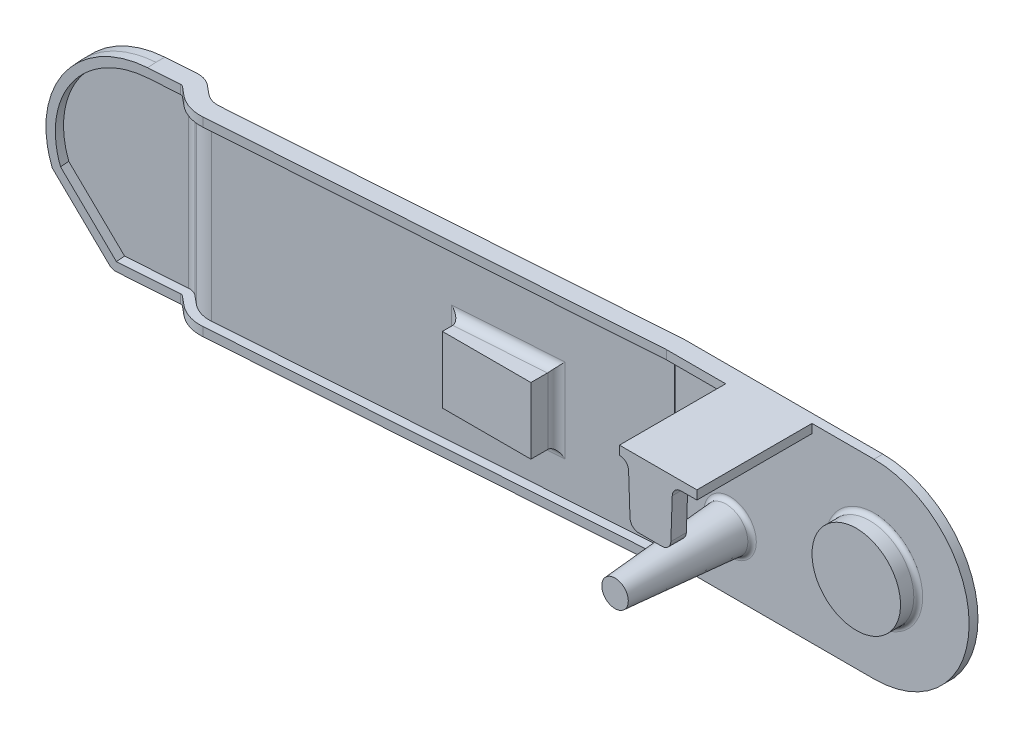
ISO-10303-21;
HEADER;
FILE_DESCRIPTION(('STEP AP214'),'2;1');
FILE_NAME('part.step','',(''),(''),'','','');
FILE_SCHEMA(('AUTOMOTIVE_DESIGN { 1 0 10303 214 1 1 1 1 }'));
ENDSEC;
DATA;
#1=APPLICATION_CONTEXT('core data for automotive mechanical design processes');
#2=APPLICATION_PROTOCOL_DEFINITION('international standard','automotive_design',2000,#1);
#3=PRODUCT_CONTEXT('',#1,'mechanical');
#4=PRODUCT('Part','Part','',(#3));
#5=PRODUCT_RELATED_PRODUCT_CATEGORY('part','',(#4));
#6=PRODUCT_DEFINITION_FORMATION('','',#4);
#7=PRODUCT_DEFINITION_CONTEXT('part definition',#1,'design');
#8=PRODUCT_DEFINITION('design','',#6,#7);
#9=PRODUCT_DEFINITION_SHAPE('','',#8);
#10=(LENGTH_UNIT() NAMED_UNIT(*) SI_UNIT(.MILLI.,.METRE.));
#11=(NAMED_UNIT(*) PLANE_ANGLE_UNIT() SI_UNIT($,.RADIAN.));
#12=(NAMED_UNIT(*) SI_UNIT($,.STERADIAN.) SOLID_ANGLE_UNIT());
#13=UNCERTAINTY_MEASURE_WITH_UNIT(LENGTH_MEASURE(1.E-05),#10,'distance_accuracy_value','');
#14=(GEOMETRIC_REPRESENTATION_CONTEXT(3) GLOBAL_UNCERTAINTY_ASSIGNED_CONTEXT((#13)) GLOBAL_UNIT_ASSIGNED_CONTEXT((#10,
#11,#12)) REPRESENTATION_CONTEXT('',''));
#15=CARTESIAN_POINT('',(0.,0.,0.));
#16=DIRECTION('',(0.,0.,1.));
#17=DIRECTION('',(1.,0.,0.));
#18=AXIS2_PLACEMENT_3D('',#15,#16,#17);
#19=CARTESIAN_POINT('',(0.,0.,4.));
#20=DIRECTION('',(0.,0.,1.));
#21=DIRECTION('',(1.,0.,0.));
#22=AXIS2_PLACEMENT_3D('',#19,#20,#21);
#23=PLANE('',#22);
#24=CARTESIAN_POINT('',(-65.,-16.,4.));
#25=DIRECTION('',(0.,0.,1.));
#26=DIRECTION('',(1.,0.,0.));
#27=AXIS2_PLACEMENT_3D('',#24,#25,#26);
#28=CIRCLE('',#27,11.8520622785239);
#29=CARTESIAN_POINT('',(-53.1479377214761,-16.,4.));
#30=VERTEX_POINT('',#29);
#31=EDGE_CURVE('E1093',#30,#30,#28,.F.);
#32=ORIENTED_EDGE('',*,*,#31,.T.);
#33=EDGE_LOOP('',(#32));
#34=FACE_BOUND('',#33,.T.);
#35=CARTESIAN_POINT('',(0.,0.,4.));
#36=DIRECTION('',(0.,0.,1.));
#37=DIRECTION('',(1.,0.,0.));
#38=AXIS2_PLACEMENT_3D('',#35,#36,#37);
#39=CIRCLE('',#38,22.);
#40=CARTESIAN_POINT('',(22.,0.,4.));
#41=VERTEX_POINT('',#40);
#42=EDGE_CURVE('E1919',#41,#41,#39,.F.);
#43=ORIENTED_EDGE('',*,*,#42,.T.);
#44=EDGE_LOOP('',(#43));
#45=FACE_BOUND('',#44,.T.);
#46=CARTESIAN_POINT('',(-62.8627550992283,35.,4.));
#47=DIRECTION('',(0.,0.,-1.));
#48=DIRECTION('',(1.,0.,0.));
#49=AXIS2_PLACEMENT_3D('',#46,#47,#48);
#50=CIRCLE('',#49,4.);
#51=CARTESIAN_POINT('',(-62.8627550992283,39.,4.));
#52=VERTEX_POINT('',#51);
#53=CARTESIAN_POINT('',(-58.8651917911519,35.13959798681,4.));
#54=VERTEX_POINT('',#53);
#55=EDGE_CURVE('E1845',#52,#54,#50,.T.);
#56=ORIENTED_EDGE('',*,*,#55,.F.);
#57=DIRECTION('',(-1.,0.,0.));
#58=VECTOR('',#57,1.);
#59=CARTESIAN_POINT('',(0.,39.,4.));
#60=LINE('',#59,#58);
#61=CARTESIAN_POINT('',(-89.721030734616,39.,4.));
#62=VERTEX_POINT('',#61);
#63=EDGE_CURVE('E58',#52,#62,#60,.T.);
#64=ORIENTED_EDGE('',*,*,#63,.T.);
#65=DIRECTION('',(0.,1.,0.));
#66=VECTOR('',#65,1.);
#67=CARTESIAN_POINT('',(-89.721030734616,0.,4.));
#68=LINE('',#67,#66);
#69=CARTESIAN_POINT('',(-89.7210307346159,-39.,4.));
#70=VERTEX_POINT('',#69);
#71=EDGE_CURVE('E688',#70,#62,#68,.T.);
#72=ORIENTED_EDGE('',*,*,#71,.F.);
#73=DIRECTION('',(1.,0.,0.));
#74=VECTOR('',#73,1.);
#75=CARTESIAN_POINT('',(0.,-39.,4.));
#76=LINE('',#75,#74);
#77=CARTESIAN_POINT('',(-87.7446628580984,-39.,4.));
#78=VERTEX_POINT('',#77);
#79=EDGE_CURVE('E668',#70,#78,#76,.T.);
#80=ORIENTED_EDGE('',*,*,#79,.T.);
#81=DIRECTION('',(0.,-1.,0.));
#82=VECTOR('',#81,1.);
#83=CARTESIAN_POINT('',(-87.7446628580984,0.,4.));
#84=LINE('',#83,#82);
#85=CARTESIAN_POINT('',(-87.7446628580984,-43.,4.));
#86=VERTEX_POINT('',#85);
#87=EDGE_CURVE('E671',#78,#86,#84,.T.);
#88=ORIENTED_EDGE('',*,*,#87,.T.);
#89=DIRECTION('',(1.,0.,0.));
#90=VECTOR('',#89,1.);
#91=CARTESIAN_POINT('',(-90.,-43.,4.));
#92=LINE('',#91,#90);
#93=CARTESIAN_POINT('',(0.,-43.,4.));
#94=VERTEX_POINT('',#93);
#95=EDGE_CURVE('E1075',#86,#94,#92,.T.);
#96=ORIENTED_EDGE('',*,*,#95,.T.);
#97=CARTESIAN_POINT('',(0.,0.,4.));
#98=DIRECTION('',(0.,0.,1.));
#99=DIRECTION('',(1.,0.,0.));
#100=AXIS2_PLACEMENT_3D('',#97,#98,#99);
#101=CIRCLE('',#100,43.);
#102=CARTESIAN_POINT('',(0.,43.,4.));
#103=VERTEX_POINT('',#102);
#104=EDGE_CURVE('E1057',#94,#103,#101,.T.);
#105=ORIENTED_EDGE('',*,*,#104,.T.);
#106=DIRECTION('',(-1.,0.,0.));
#107=VECTOR('',#106,1.);
#108=CARTESIAN_POINT('',(0.,43.,4.));
#109=LINE('',#108,#107);
#110=CARTESIAN_POINT('',(-28.,43.,4.));
#111=VERTEX_POINT('',#110);
#112=EDGE_CURVE('E1084',#103,#111,#109,.T.);
#113=ORIENTED_EDGE('',*,*,#112,.T.);
#114=DIRECTION('',(0.,1.,0.));
#115=VECTOR('',#114,1.);
#116=CARTESIAN_POINT('',(-28.,39.,4.));
#117=LINE('',#116,#115);
#118=CARTESIAN_POINT('',(-28.,39.,4.));
#119=VERTEX_POINT('',#118);
#120=EDGE_CURVE('E1896',#119,#111,#117,.T.);
#121=ORIENTED_EDGE('',*,*,#120,.F.);
#122=DIRECTION('',(1.,0.,0.));
#123=VECTOR('',#122,1.);
#124=CARTESIAN_POINT('',(-35.1372449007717,39.,4.));
#125=LINE('',#124,#123);
#126=CARTESIAN_POINT('',(-35.1372449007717,39.,4.));
#127=VERTEX_POINT('',#126);
#128=EDGE_CURVE('E1888',#127,#119,#125,.T.);
#129=ORIENTED_EDGE('',*,*,#128,.F.);
#130=CARTESIAN_POINT('',(-35.1372449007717,35.,4.));
#131=DIRECTION('',(0.,0.,-1.));
#132=DIRECTION('',(-1.,0.,0.));
#133=AXIS2_PLACEMENT_3D('',#130,#131,#132);
#134=CIRCLE('',#133,4.);
#135=CARTESIAN_POINT('',(-39.134808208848,35.13959798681,4.));
#136=VERTEX_POINT('',#135);
#137=EDGE_CURVE('E1892',#136,#127,#134,.T.);
#138=ORIENTED_EDGE('',*,*,#137,.F.);
#139=DIRECTION('',(0.0348994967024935,0.999390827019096,0.));
#140=VECTOR('',#139,1.);
#141=CARTESIAN_POINT('',(-39.7731317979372,16.86040201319,4.));
#142=LINE('',#141,#140);
#143=CARTESIAN_POINT('',(-39.2309837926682,32.3854896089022,4.));
#144=VERTEX_POINT('',#143);
#145=EDGE_CURVE('E1894',#144,#136,#142,.T.);
#146=ORIENTED_EDGE('',*,*,#145,.F.);
#147=DIRECTION('',(0.999390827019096,-0.0348994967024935,0.));
#148=VECTOR('',#147,1.);
#149=CARTESIAN_POINT('',(-360.479952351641,43.6037507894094,4.));
#150=LINE('',#149,#148);
#151=CARTESIAN_POINT('',(-58.7928711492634,33.0686057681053,4.));
#152=VERTEX_POINT('',#151);
#153=EDGE_CURVE('E50',#152,#144,#150,.T.);
#154=ORIENTED_EDGE('',*,*,#153,.F.);
#155=DIRECTION('',(0.0348994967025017,-0.999390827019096,0.));
#156=VECTOR('',#155,1.);
#157=CARTESIAN_POINT('',(-58.8651917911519,35.13959798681,4.));
#158=LINE('',#157,#156);
#159=EDGE_CURVE('E1847',#54,#152,#158,.T.);
#160=ORIENTED_EDGE('',*,*,#159,.F.);
#161=EDGE_LOOP('',(#56,#64,#72,#80,#88,#96,#105,#113,#121,#129,#138,#146,#154,#160));
#162=FACE_BOUND('',#161,.T.);
#163=ADVANCED_FACE('F33',(#34,#45,#162),#23,.T.);
#164=DIRECTION('',(0.,-1.,0.));
#165=VECTOR('',#164,1.);
#166=CARTESIAN_POINT('',(-89.860316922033,0.,4.));
#167=LINE('',#166,#165);
#168=CARTESIAN_POINT('',(-89.8603169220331,39.,4.));
#169=VERTEX_POINT('',#168);
#170=CARTESIAN_POINT('',(-89.8603169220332,-39.,4.));
#171=VERTEX_POINT('',#170);
#172=EDGE_CURVE('E704',#169,#171,#167,.T.);
#173=ORIENTED_EDGE('',*,*,#172,.F.);
#174=DIRECTION('',(1.,0.,0.));
#175=VECTOR('',#174,1.);
#176=CARTESIAN_POINT('',(-63.,39.,4.));
#177=LINE('',#176,#175);
#178=CARTESIAN_POINT('',(-90.0000000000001,39.,4.));
#179=VERTEX_POINT('',#178);
#180=EDGE_CURVE('E477',#179,#169,#177,.T.);
#181=ORIENTED_EDGE('',*,*,#180,.F.);
#182=DIRECTION('',(0.,-1.,0.));
#183=VECTOR('',#182,1.);
#184=CARTESIAN_POINT('',(-90.,43.,4.));
#185=LINE('',#184,#183);
#186=CARTESIAN_POINT('',(-90.,-43.,4.));
#187=VERTEX_POINT('',#186);
#188=EDGE_CURVE('E37',#179,#187,#185,.T.);
#189=ORIENTED_EDGE('',*,*,#188,.T.);
#190=CARTESIAN_POINT('',(-89.860316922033,-43.,4.));
#191=VERTEX_POINT('',#190);
#192=EDGE_CURVE('E1078',#187,#191,#92,.T.);
#193=ORIENTED_EDGE('',*,*,#192,.T.);
#194=DIRECTION('',(0.,-1.,0.));
#195=VECTOR('',#194,1.);
#196=CARTESIAN_POINT('',(-89.8603169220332,0.,4.));
#197=LINE('',#196,#195);
#198=EDGE_CURVE('E663',#171,#191,#197,.T.);
#199=ORIENTED_EDGE('',*,*,#198,.F.);
#200=EDGE_LOOP('',(#173,#181,#189,#193,#199));
#201=FACE_BOUND('',#200,.T.);
#202=ADVANCED_FACE('F750',(#201),#23,.T.);
#203=CARTESIAN_POINT('',(-90.,0.,52.));
#204=DIRECTION('',(1.,0.,0.));
#205=DIRECTION('',(0.,0.,-1.));
#206=AXIS2_PLACEMENT_3D('',#203,#204,#205);
#207=PLANE('',#206);
#208=ORIENTED_EDGE('',*,*,#188,.F.);
#209=DIRECTION('',(0.,0.,-1.));
#210=VECTOR('',#209,1.);
#211=CARTESIAN_POINT('',(-90.0000000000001,39.,8.));
#212=LINE('',#211,#210);
#213=CARTESIAN_POINT('',(-90.0000000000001,39.,4.00976759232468));
#214=VERTEX_POINT('',#213);
#215=EDGE_CURVE('E485',#214,#179,#212,.T.);
#216=ORIENTED_EDGE('',*,*,#215,.F.);
#217=DIRECTION('',(0.,1.,0.));
#218=VECTOR('',#217,1.);
#219=CARTESIAN_POINT('',(-90.,0.,4.00976759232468));
#220=LINE('',#219,#218);
#221=CARTESIAN_POINT('',(-90.,-39.,4.00976759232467));
#222=VERTEX_POINT('',#221);
#223=EDGE_CURVE('E1069',#222,#214,#220,.T.);
#224=ORIENTED_EDGE('',*,*,#223,.F.);
#225=CARTESIAN_POINT('',(-90.,-43.,4.00976759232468));
#226=VERTEX_POINT('',#225);
#227=EDGE_CURVE('E1071',#226,#222,#220,.T.);
#228=ORIENTED_EDGE('',*,*,#227,.F.);
#229=DIRECTION('',(0.,0.,-1.));
#230=VECTOR('',#229,1.);
#231=CARTESIAN_POINT('',(-90.,-43.,52.));
#232=LINE('',#231,#230);
#233=EDGE_CURVE('E1027',#226,#187,#232,.T.);
#234=ORIENTED_EDGE('',*,*,#233,.T.);
#235=EDGE_LOOP('',(#208,#216,#224,#228,#234));
#236=FACE_BOUND('',#235,.T.);
#237=ADVANCED_FACE('F756',(#236),#207,.T.);
#238=CARTESIAN_POINT('',(-87.4759316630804,39.,7.84303513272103));
#239=DIRECTION('',(0.0697564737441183,0.,0.997564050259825));
#240=DIRECTION('',(0.997564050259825,0.,-0.0697564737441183));
#241=AXIS2_PLACEMENT_3D('',#238,#239,#240);
#242=PLANE('',#241);
#243=DIRECTION('',(0.997564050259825,0.,-0.0697564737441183));
#244=VECTOR('',#243,1.);
#245=CARTESIAN_POINT('',(-268.831135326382,39.,20.5246263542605));
#246=LINE('',#245,#244);
#247=CARTESIAN_POINT('',(-285.440284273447,38.9999999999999,21.6860511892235));
#248=VERTEX_POINT('',#247);
#249=CARTESIAN_POINT('',(-89.7206338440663,39.,8.));
#250=VERTEX_POINT('',#249);
#251=EDGE_CURVE('E680',#248,#250,#246,.T.);
#252=ORIENTED_EDGE('',*,*,#251,.T.);
#253=DIRECTION('',(0.,1.,0.));
#254=VECTOR('',#253,1.);
#255=CARTESIAN_POINT('',(-89.7206338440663,39.,8.));
#256=LINE('',#255,#254);
#257=CARTESIAN_POINT('',(-89.7206338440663,43.,8.));
#258=VERTEX_POINT('',#257);
#259=EDGE_CURVE('E11',#250,#258,#256,.T.);
#260=ORIENTED_EDGE('',*,*,#259,.T.);
#261=DIRECTION('',(-0.997564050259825,0.,0.0697564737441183));
#262=VECTOR('',#261,1.);
#263=CARTESIAN_POINT('',(-268.831135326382,43.,20.5246263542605));
#264=LINE('',#263,#262);
#265=CARTESIAN_POINT('',(-285.440284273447,42.9999999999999,21.6860511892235));
#266=VERTEX_POINT('',#265);
#267=EDGE_CURVE('E678',#258,#266,#264,.T.);
#268=ORIENTED_EDGE('',*,*,#267,.T.);
#269=DIRECTION('',(0.,1.,0.));
#270=VECTOR('',#269,1.);
#271=CARTESIAN_POINT('',(-285.440284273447,38.9999999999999,21.6860511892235));
#272=LINE('',#271,#270);
#273=EDGE_CURVE('E552',#248,#266,#272,.T.);
#274=ORIENTED_EDGE('',*,*,#273,.F.);
#275=EDGE_LOOP('',(#252,#260,#268,#274));
#276=FACE_BOUND('',#275,.T.);
#277=ADVANCED_FACE('F781',(#276),#242,.T.);
#278=CARTESIAN_POINT('',(-89.7209741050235,-43.0002650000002,3.99025620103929));
#279=DIRECTION('',(-0.0697564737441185,0.,-0.997564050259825));
#280=DIRECTION('',(-0.997564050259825,0.,0.0697564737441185));
#281=AXIS2_PLACEMENT_3D('',#278,#279,#280);
#282=PLANE('',#281);
#283=DIRECTION('',(0.997564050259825,0.,-0.0697564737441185));
#284=VECTOR('',#283,1.);
#285=CARTESIAN_POINT('',(-180.,-23.5,10.30318066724));
#286=LINE('',#285,#284);
#287=CARTESIAN_POINT('',(-136.279025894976,-23.5,7.24591233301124));
#288=VERTEX_POINT('',#287);
#289=CARTESIAN_POINT('',(-184.279025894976,-23.5,10.6023993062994));
#290=VERTEX_POINT('',#289);
#291=EDGE_CURVE('E825',#288,#290,#286,.F.);
#292=ORIENTED_EDGE('',*,*,#291,.T.);
#293=DIRECTION('',(0.,-1.,0.));
#294=VECTOR('',#293,1.);
#295=CARTESIAN_POINT('',(-184.279025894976,10.5,10.6023993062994));
#296=LINE('',#295,#294);
#297=CARTESIAN_POINT('',(-184.279025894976,14.5,10.6023993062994));
#298=VERTEX_POINT('',#297);
#299=EDGE_CURVE('E827',#290,#298,#296,.F.);
#300=ORIENTED_EDGE('',*,*,#299,.T.);
#301=DIRECTION('',(-0.997564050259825,0.,0.0697564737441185));
#302=VECTOR('',#301,1.);
#303=CARTESIAN_POINT('',(-140.,14.5,7.50610818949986));
#304=LINE('',#303,#302);
#305=CARTESIAN_POINT('',(-136.279025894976,14.5,7.24591233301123));
#306=VERTEX_POINT('',#305);
#307=EDGE_CURVE('E823',#298,#306,#304,.F.);
#308=ORIENTED_EDGE('',*,*,#307,.T.);
#309=DIRECTION('',(0.,1.,0.));
#310=VECTOR('',#309,1.);
#311=CARTESIAN_POINT('',(-136.279025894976,-19.5,7.24591233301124));
#312=LINE('',#311,#310);
#313=EDGE_CURVE('E820',#306,#288,#312,.F.);
#314=ORIENTED_EDGE('',*,*,#313,.T.);
#315=EDGE_LOOP('',(#292,#300,#308,#314));
#316=FACE_BOUND('',#315,.T.);
#317=DIRECTION('',(0.997564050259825,0.,-0.0697564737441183));
#318=VECTOR('',#317,1.);
#319=CARTESIAN_POINT('',(-269.110161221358,39.,16.5343701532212));
#320=LINE('',#319,#318);
#321=CARTESIAN_POINT('',(-285.719310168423,38.9999999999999,17.6957949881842));
#322=VERTEX_POINT('',#321);
#323=EDGE_CURVE('E675',#322,#214,#320,.T.);
#324=ORIENTED_EDGE('',*,*,#323,.F.);
#325=DIRECTION('',(0.,1.,0.));
#326=VECTOR('',#325,1.);
#327=CARTESIAN_POINT('',(-285.719310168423,-43.0002650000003,17.6957949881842));
#328=LINE('',#327,#326);
#329=CARTESIAN_POINT('',(-285.719310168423,-38.9999999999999,17.6957949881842));
#330=VERTEX_POINT('',#329);
#331=EDGE_CURVE('E695',#330,#322,#328,.T.);
#332=ORIENTED_EDGE('',*,*,#331,.F.);
#333=DIRECTION('',(-0.997564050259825,0.,0.0697564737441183));
#334=VECTOR('',#333,1.);
#335=CARTESIAN_POINT('',(-269.110161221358,-39.,16.5343701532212));
#336=LINE('',#335,#334);
#337=EDGE_CURVE('E644',#222,#330,#336,.T.);
#338=ORIENTED_EDGE('',*,*,#337,.F.);
#339=ORIENTED_EDGE('',*,*,#223,.T.);
#340=EDGE_LOOP('',(#324,#332,#338,#339));
#341=FACE_BOUND('',#340,.T.);
#342=ADVANCED_FACE('F882',(#316,#341),#282,.F.);
#343=CARTESIAN_POINT('',(-285.998336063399,-43.0000500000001,13.7055387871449));
#344=DIRECTION('',(0.0697564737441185,0.,0.997564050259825));
#345=DIRECTION('',(0.997564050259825,0.,-0.0697564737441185));
#346=AXIS2_PLACEMENT_3D('',#343,#344,#345);
#347=PLANE('',#346);
#348=DIRECTION('',(0.,1.,0.));
#349=VECTOR('',#348,1.);
#350=CARTESIAN_POINT('',(-90.,-43.00005,0.));
#351=LINE('',#350,#349);
#352=CARTESIAN_POINT('',(-90.,-43.0000025,0.));
#353=VERTEX_POINT('',#352);
#354=CARTESIAN_POINT('',(-90.,43.,0.));
#355=VERTEX_POINT('',#354);
#356=EDGE_CURVE('E1132',#353,#355,#351,.T.);
#357=ORIENTED_EDGE('',*,*,#356,.F.);
#358=DIRECTION('',(0.997564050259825,0.,-0.0697564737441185));
#359=VECTOR('',#358,1.);
#360=CARTESIAN_POINT('',(-90.2783462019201,-43.,0.0194638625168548));
#361=LINE('',#360,#359);
#362=CARTESIAN_POINT('',(-285.998336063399,-42.9999999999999,13.7055387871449));
#363=VERTEX_POINT('',#362);
#364=EDGE_CURVE('E1042',#363,#353,#361,.T.);
#365=ORIENTED_EDGE('',*,*,#364,.F.);
#366=DIRECTION('',(0.,1.,0.));
#367=VECTOR('',#366,1.);
#368=CARTESIAN_POINT('',(-285.998336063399,-43.0000500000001,13.7055387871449));
#369=LINE('',#368,#367);
#370=CARTESIAN_POINT('',(-285.998336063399,42.9999999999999,13.7055387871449));
#371=VERTEX_POINT('',#370);
#372=EDGE_CURVE('E1107',#363,#371,#369,.T.);
#373=ORIENTED_EDGE('',*,*,#372,.T.);
#374=DIRECTION('',(0.997564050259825,0.,-0.0697564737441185));
#375=VECTOR('',#374,1.);
#376=CARTESIAN_POINT('',(-285.998336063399,42.9999999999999,13.7055387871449));
#377=LINE('',#376,#375);
#378=EDGE_CURVE('E1145',#371,#355,#377,.T.);
#379=ORIENTED_EDGE('',*,*,#378,.T.);
#380=EDGE_LOOP('',(#357,#365,#373,#379));
#381=FACE_BOUND('',#380,.T.);
#382=ADVANCED_FACE('F1206',(#381),#347,.F.);
#383=CARTESIAN_POINT('',(-286.695900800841,-43.0002650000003,3.72989828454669));
#384=DIRECTION('',(0.,1.,0.));
#385=DIRECTION('',(-1.,0.,0.));
#386=AXIS2_PLACEMENT_3D('',#383,#384,#385);
#387=CYLINDRICAL_SURFACE('',#386,14.);
#388=CARTESIAN_POINT('',(-286.695900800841,38.9999999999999,3.72989828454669));
#389=DIRECTION('',(0.,-1.,0.));
#390=DIRECTION('',(-1.,0.,0.));
#391=AXIS2_PLACEMENT_3D('',#388,#389,#390);
#392=CIRCLE('',#391,14.);
#393=CARTESIAN_POINT('',(-295.641609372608,38.9999999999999,14.4990346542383));
#394=VERTEX_POINT('',#393);
#395=EDGE_CURVE('E545',#322,#394,#392,.T.);
#396=ORIENTED_EDGE('',*,*,#395,.T.);
#397=DIRECTION('',(0.,1.,0.));
#398=VECTOR('',#397,1.);
#399=CARTESIAN_POINT('',(-295.641609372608,-43.0002650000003,14.4990346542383));
#400=LINE('',#399,#398);
#401=CARTESIAN_POINT('',(-295.641609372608,-38.9999999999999,14.4990346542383));
#402=VERTEX_POINT('',#401);
#403=EDGE_CURVE('E692',#402,#394,#400,.T.);
#404=ORIENTED_EDGE('',*,*,#403,.F.);
#405=CARTESIAN_POINT('',(-286.695900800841,-38.9999999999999,3.72989828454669));
#406=DIRECTION('',(0.,1.,0.));
#407=DIRECTION('',(1.,0.,0.));
#408=AXIS2_PLACEMENT_3D('',#405,#406,#407);
#409=CIRCLE('',#408,14.);
#410=EDGE_CURVE('E583',#402,#330,#409,.T.);
#411=ORIENTED_EDGE('',*,*,#410,.T.);
#412=ORIENTED_EDGE('',*,*,#331,.T.);
#413=EDGE_LOOP('',(#396,#404,#411,#412));
#414=FACE_BOUND('',#413,.T.);
#415=ADVANCED_FACE('F1202',(#414),#387,.T.);
#416=CARTESIAN_POINT('',(-295.641609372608,-43.0002650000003,14.4990346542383));
#417=DIRECTION('',(0.638979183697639,0.,-0.769224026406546));
#418=DIRECTION('',(-0.769224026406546,0.,-0.638979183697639));
#419=AXIS2_PLACEMENT_3D('',#416,#417,#418);
#420=PLANE('',#419);
#421=DIRECTION('',(-0.769224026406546,0.,-0.638979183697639));
#422=VECTOR('',#421,1.);
#423=CARTESIAN_POINT('',(-295.641609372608,38.9999999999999,14.4990346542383));
#424=LINE('',#423,#422);
#425=CARTESIAN_POINT('',(-299.470224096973,38.9999999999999,11.3186801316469));
#426=VERTEX_POINT('',#425);
#427=EDGE_CURVE('E548',#394,#426,#424,.T.);
#428=ORIENTED_EDGE('',*,*,#427,.T.);
#429=DIRECTION('',(0.,1.,0.));
#430=VECTOR('',#429,1.);
#431=CARTESIAN_POINT('',(-299.470224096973,-43.0002650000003,11.3186801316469));
#432=LINE('',#431,#430);
#433=CARTESIAN_POINT('',(-299.470224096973,-38.9999999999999,11.3186801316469));
#434=VERTEX_POINT('',#433);
#435=EDGE_CURVE('E689',#434,#426,#432,.T.);
#436=ORIENTED_EDGE('',*,*,#435,.F.);
#437=DIRECTION('',(0.769224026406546,0.,0.638979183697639));
#438=VECTOR('',#437,1.);
#439=CARTESIAN_POINT('',(-295.641609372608,-38.9999999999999,14.4990346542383));
#440=LINE('',#439,#438);
#441=EDGE_CURVE('E580',#434,#402,#440,.T.);
#442=ORIENTED_EDGE('',*,*,#441,.T.);
#443=ORIENTED_EDGE('',*,*,#403,.T.);
#444=EDGE_LOOP('',(#428,#436,#442,#443));
#445=FACE_BOUND('',#444,.T.);
#446=ADVANCED_FACE('F1198',(#445),#420,.F.);
#447=CARTESIAN_POINT('',(-303.304099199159,-43.0002650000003,15.9340242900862));
#448=DIRECTION('',(0.,1.,0.));
#449=DIRECTION('',(-1.,0.,0.));
#450=AXIS2_PLACEMENT_3D('',#447,#448,#449);
#451=CYLINDRICAL_SURFACE('',#450,5.99999999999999);
#452=CARTESIAN_POINT('',(-303.304099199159,38.9999999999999,15.9340242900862));
#453=DIRECTION('',(0.,1.,0.));
#454=DIRECTION('',(-1.,0.,0.));
#455=AXIS2_PLACEMENT_3D('',#452,#453,#454);
#456=CIRCLE('',#455,5.99999999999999);
#457=CARTESIAN_POINT('',(-303.722638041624,38.9999999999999,9.94863998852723));
#458=VERTEX_POINT('',#457);
#459=EDGE_CURVE('E531',#426,#458,#456,.T.);
#460=ORIENTED_EDGE('',*,*,#459,.T.);
#461=DIRECTION('',(0.,1.,0.));
#462=VECTOR('',#461,1.);
#463=CARTESIAN_POINT('',(-303.722638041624,-43.0002650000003,9.94863998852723));
#464=LINE('',#463,#462);
#465=CARTESIAN_POINT('',(-303.722638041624,-38.9999999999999,9.94863998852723));
#466=VERTEX_POINT('',#465);
#467=EDGE_CURVE('E685',#466,#458,#464,.T.);
#468=ORIENTED_EDGE('',*,*,#467,.F.);
#469=CARTESIAN_POINT('',(-303.304099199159,-38.9999999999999,15.9340242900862));
#470=DIRECTION('',(0.,-1.,0.));
#471=DIRECTION('',(1.,0.,0.));
#472=AXIS2_PLACEMENT_3D('',#469,#470,#471);
#473=CIRCLE('',#472,5.99999999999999);
#474=EDGE_CURVE('E577',#466,#434,#473,.T.);
#475=ORIENTED_EDGE('',*,*,#474,.T.);
#476=ORIENTED_EDGE('',*,*,#435,.T.);
#477=EDGE_LOOP('',(#460,#468,#475,#476));
#478=FACE_BOUND('',#477,.T.);
#479=ADVANCED_FACE('F1193',(#478),#451,.F.);
#480=CARTESIAN_POINT('',(-317.220974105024,-43.0002650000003,10.8925355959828));
#481=DIRECTION('',(-0.0697564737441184,0.,-0.997564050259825));
#482=DIRECTION('',(-0.997564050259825,0.,0.0697564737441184));
#483=AXIS2_PLACEMENT_3D('',#480,#481,#482);
#484=PLANE('',#483);
#485=DIRECTION('',(-0.997564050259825,0.,0.0697564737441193));
#486=VECTOR('',#485,1.);
#487=CARTESIAN_POINT('',(-303.722638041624,38.9999999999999,9.94863998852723));
#488=LINE('',#487,#486);
#489=CARTESIAN_POINT('',(-317.5,38.9999999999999,10.9120469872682));
#490=VERTEX_POINT('',#489);
#491=EDGE_CURVE('E534',#458,#490,#488,.T.);
#492=ORIENTED_EDGE('',*,*,#491,.T.);
#493=CARTESIAN_POINT('',(-354.314794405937,-12.897588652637,13.4863881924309));
#494=CARTESIAN_POINT('',(-355.340170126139,-9.97222623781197,13.5580894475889));
#495=CARTESIAN_POINT('',(-356.014958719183,-6.92434334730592,13.6052752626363));
#496=CARTESIAN_POINT('',(-356.625463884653,-0.755221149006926,13.6479659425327));
#497=CARTESIAN_POINT('',(-356.56114907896,2.36569116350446,13.6434686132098));
#498=CARTESIAN_POINT('',(-355.696995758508,8.50446860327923,13.5830411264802));
#499=CARTESIAN_POINT('',(-354.897201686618,11.5220081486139,13.5271140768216));
#500=CARTESIAN_POINT('',(-352.607102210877,17.2833943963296,13.3669747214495));
#501=CARTESIAN_POINT('',(-351.116915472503,20.0269333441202,13.2627707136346));
#502=CARTESIAN_POINT('',(-347.530051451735,25.0849953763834,13.0119527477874));
#503=CARTESIAN_POINT('',(-345.43356234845,27.3992450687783,12.8653519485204));
#504=CARTESIAN_POINT('',(-340.752498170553,31.4675103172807,12.5380200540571));
#505=CARTESIAN_POINT('',(-338.168172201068,33.2213029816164,12.3573063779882));
#506=CARTESIAN_POINT('',(-332.657625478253,36.0690472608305,11.971971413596));
#507=CARTESIAN_POINT('',(-329.731701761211,37.1628409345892,11.7673708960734));
#508=CARTESIAN_POINT('',(-323.703689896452,38.6283582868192,11.3458512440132));
#509=CARTESIAN_POINT('',(-320.601929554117,39.,11.1289550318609));
#510=CARTESIAN_POINT('',(-317.5,39.,10.9120469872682));
#511=B_SPLINE_CURVE_WITH_KNOTS('',3,(#493,#494,#495,#496,#497,#498,#499,#500,#501,#502,#503,
#504,#505,#506,#507,#508,#509,#510),.UNSPECIFIED.,.F.,.F.,(4,2,2,2,2,2,2,2,4),(0.,0.125,0.25,
0.375,0.5,0.625,0.75,0.875,0.999999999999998),.UNSPECIFIED.);
#512=CARTESIAN_POINT('',(-354.314794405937,-12.897588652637,13.4863881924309));
#513=VERTEX_POINT('',#512);
#514=EDGE_CURVE('E598',#513,#490,#511,.T.);
#515=ORIENTED_EDGE('',*,*,#514,.F.);
#516=DIRECTION('',(-0.669675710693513,0.741175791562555,0.0468282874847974));
#517=VECTOR('',#516,1.);
#518=CARTESIAN_POINT('',(-330.733694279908,-38.9964007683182,11.8374370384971));
#519=LINE('',#518,#517);
#520=CARTESIAN_POINT('',(-330.733694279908,-38.9964007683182,11.8374370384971));
#521=VERTEX_POINT('',#520);
#522=EDGE_CURVE('E974',#521,#513,#519,.T.);
#523=ORIENTED_EDGE('',*,*,#522,.F.);
#524=CARTESIAN_POINT('',(-330.723216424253,-38.9999999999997,11.8367043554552));
#525=CARTESIAN_POINT('',(-330.728980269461,-39.0000000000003,11.8371074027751));
#526=CARTESIAN_POINT('',(-330.733128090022,-38.9970274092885,11.8373974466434));
#527=CARTESIAN_POINT('',(-330.733694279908,-38.9964007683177,11.8374370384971));
#528=B_SPLINE_CURVE_WITH_KNOTS('',3,(#524,#525,#526,#527),.UNSPECIFIED.,.F.,.F.,(4,4),
(-9.04126690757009E-11,1.00000000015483),.UNSPECIFIED.);
#529=CARTESIAN_POINT('',(-330.723216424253,-38.9999999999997,11.8367043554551));
#530=VERTEX_POINT('',#529);
#531=EDGE_CURVE('E641',#530,#521,#528,.T.);
#532=ORIENTED_EDGE('',*,*,#531,.F.);
#533=DIRECTION('',(-0.997564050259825,0.,0.0697564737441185));
#534=VECTOR('',#533,1.);
#535=CARTESIAN_POINT('',(-303.722638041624,-38.9999999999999,9.94863998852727));
#536=LINE('',#535,#534);
#537=EDGE_CURVE('E589',#466,#530,#536,.T.);
#538=ORIENTED_EDGE('',*,*,#537,.F.);
#539=ORIENTED_EDGE('',*,*,#467,.T.);
#540=EDGE_LOOP('',(#492,#515,#523,#532,#538,#539));
#541=FACE_BOUND('',#540,.T.);
#542=ADVANCED_FACE('F1181',(#541),#484,.F.);
#543=CARTESIAN_POINT('',(-89.7209741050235,-39.,3.99025620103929));
#544=VERTEX_POINT('',#543);
#545=EDGE_CURVE('E648',#544,#171,#336,.T.);
#546=ORIENTED_EDGE('',*,*,#545,.F.);
#547=DIRECTION('',(0.,1.,0.));
#548=VECTOR('',#547,1.);
#549=CARTESIAN_POINT('',(-89.7209741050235,-43.0002650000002,3.99025620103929));
#550=LINE('',#549,#548);
#551=CARTESIAN_POINT('',(-89.7209741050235,39.,3.99025620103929));
#552=VERTEX_POINT('',#551);
#553=EDGE_CURVE('E684',#544,#552,#550,.T.);
#554=ORIENTED_EDGE('',*,*,#553,.T.);
#555=EDGE_CURVE('E674',#169,#552,#320,.T.);
#556=ORIENTED_EDGE('',*,*,#555,.F.);
#557=ORIENTED_EDGE('',*,*,#172,.T.);
#558=EDGE_LOOP('',(#546,#554,#556,#557));
#559=FACE_BOUND('',#558,.T.);
#560=ADVANCED_FACE('F747',(#559),#282,.F.);
#561=CARTESIAN_POINT('',(-89.7209741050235,-43.0002650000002,3.99025620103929));
#562=DIRECTION('',(0.999983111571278,0.,0.00581176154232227));
#563=DIRECTION('',(0.00581176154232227,0.,-0.999983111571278));
#564=AXIS2_PLACEMENT_3D('',#561,#562,#563);
#565=PLANE('',#564);
#566=DIRECTION('',(0.00581176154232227,0.,-0.999983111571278));
#567=VECTOR('',#566,1.);
#568=CARTESIAN_POINT('',(-89.7209741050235,-39.,3.99025620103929));
#569=LINE('',#568,#567);
#570=EDGE_CURVE('E666',#70,#544,#569,.T.);
#571=ORIENTED_EDGE('',*,*,#570,.F.);
#572=ORIENTED_EDGE('',*,*,#71,.T.);
#573=DIRECTION('',(-0.00581176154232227,0.,0.999983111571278));
#574=VECTOR('',#573,1.);
#575=CARTESIAN_POINT('',(-89.7209741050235,39.,3.99025620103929));
#576=LINE('',#575,#574);
#577=EDGE_CURVE('E821',#552,#62,#576,.T.);
#578=ORIENTED_EDGE('',*,*,#577,.F.);
#579=ORIENTED_EDGE('',*,*,#553,.F.);
#580=EDGE_LOOP('',(#571,#572,#578,#579));
#581=FACE_BOUND('',#580,.T.);
#582=ADVANCED_FACE('F739',(#581),#565,.F.);
#583=CARTESIAN_POINT('',(-296.914307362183,-43.0000500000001,8.24178402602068));
#584=DIRECTION('',(-0.63897918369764,0.,0.769224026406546));
#585=DIRECTION('',(0.769224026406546,0.,0.63897918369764));
#586=AXIS2_PLACEMENT_3D('',#583,#584,#585);
#587=PLANE('',#586);
#588=CARTESIAN_POINT('',(-317.5,0.,-8.85834366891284));
#589=DIRECTION('',(-0.63897918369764,0.,0.769224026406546));
#590=DIRECTION('',(-0.769224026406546,0.,-0.63897918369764));
#591=AXIS2_PLACEMENT_3D('',#588,#589,#590);
#592=ELLIPSE('',#591,29.2502563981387,22.5);
#593=CARTESIAN_POINT('',(-296.914307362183,9.0818092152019,8.24178402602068));
#594=VERTEX_POINT('',#593);
#595=CARTESIAN_POINT('',(-296.914307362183,-9.08180921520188,8.24178402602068));
#596=VERTEX_POINT('',#595);
#597=EDGE_CURVE('E719',#594,#596,#592,.F.);
#598=ORIENTED_EDGE('',*,*,#597,.F.);
#599=DIRECTION('',(0.,1.,0.));
#600=VECTOR('',#599,1.);
#601=CARTESIAN_POINT('',(-296.914307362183,-43.0000500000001,8.24178402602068));
#602=LINE('',#601,#600);
#603=CARTESIAN_POINT('',(-296.914307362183,42.9999999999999,8.24178402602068));
#604=VERTEX_POINT('',#603);
#605=EDGE_CURVE('E1117',#594,#604,#602,.T.);
#606=ORIENTED_EDGE('',*,*,#605,.T.);
#607=DIRECTION('',(0.769224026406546,0.,0.63897918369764));
#608=VECTOR('',#607,1.);
#609=CARTESIAN_POINT('',(-296.914307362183,42.9999999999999,8.24178402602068));
#610=LINE('',#609,#608);
#611=CARTESIAN_POINT('',(-293.085692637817,42.9999999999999,11.4221385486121));
#612=VERTEX_POINT('',#611);
#613=EDGE_CURVE('E1111',#604,#612,#610,.T.);
#614=ORIENTED_EDGE('',*,*,#613,.T.);
#615=DIRECTION('',(0.,1.,0.));
#616=VECTOR('',#615,1.);
#617=CARTESIAN_POINT('',(-293.085692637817,-43.0000500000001,11.4221385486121));
#618=LINE('',#617,#616);
#619=CARTESIAN_POINT('',(-293.085692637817,-42.9999999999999,11.4221385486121));
#620=VERTEX_POINT('',#619);
#621=EDGE_CURVE('E1105',#620,#612,#618,.T.);
#622=ORIENTED_EDGE('',*,*,#621,.F.);
#623=DIRECTION('',(0.769224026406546,0.,0.63897918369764));
#624=VECTOR('',#623,1.);
#625=CARTESIAN_POINT('',(-176.566866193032,-43.,108.212022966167));
#626=LINE('',#625,#624);
#627=CARTESIAN_POINT('',(-296.914307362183,-42.9999999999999,8.24178402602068));
#628=VERTEX_POINT('',#627);
#629=EDGE_CURVE('E1096',#628,#620,#626,.T.);
#630=ORIENTED_EDGE('',*,*,#629,.F.);
#631=EDGE_CURVE('E1113',#628,#596,#602,.T.);
#632=ORIENTED_EDGE('',*,*,#631,.T.);
#633=EDGE_LOOP('',(#598,#606,#614,#622,#630,#632));
#634=FACE_BOUND('',#633,.T.);
#635=ADVANCED_FACE('F737',(#634),#587,.F.);
#636=CARTESIAN_POINT('',(-303.304099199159,-43.0000500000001,15.9340242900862));
#637=DIRECTION('',(0.,1.,0.));
#638=DIRECTION('',(-1.,0.,0.));
#639=AXIS2_PLACEMENT_3D('',#636,#637,#638);
#640=CYLINDRICAL_SURFACE('',#639,9.99999999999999);
#641=CARTESIAN_POINT('',(-312.002110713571,21.8179562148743,11.));
#642=CARTESIAN_POINT('',(-311.869910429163,21.7846352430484,10.7668562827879));
#643=CARTESIAN_POINT('',(-311.728478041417,21.7477262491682,10.5394565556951));
#644=CARTESIAN_POINT('',(-311.428627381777,21.6659334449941,10.0976670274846));
#645=CARTESIAN_POINT('',(-311.270209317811,21.6210497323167,9.88327706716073));
#646=CARTESIAN_POINT('',(-310.938219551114,21.5226138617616,9.46946850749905));
#647=CARTESIAN_POINT('',(-310.764681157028,21.4690805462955,9.27001871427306));
#648=CARTESIAN_POINT('',(-310.403912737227,21.3525518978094,8.88690726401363));
#649=CARTESIAN_POINT('',(-310.216683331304,21.2895569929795,8.70324489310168));
#650=CARTESIAN_POINT('',(-309.830261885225,21.1534183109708,8.35264368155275));
#651=CARTESIAN_POINT('',(-309.631058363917,21.0802647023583,8.18572131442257));
#652=CARTESIAN_POINT('',(-309.222941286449,20.9233860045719,7.86966298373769));
#653=CARTESIAN_POINT('',(-309.014027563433,20.839660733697,7.72052732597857));
#654=CARTESIAN_POINT('',(-308.588755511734,20.6613855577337,7.44066314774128));
#655=CARTESIAN_POINT('',(-308.372399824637,20.5668394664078,7.3099281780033));
#656=CARTESIAN_POINT('',(-307.93438561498,20.3668108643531,7.06705384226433));
#657=CARTESIAN_POINT('',(-307.712727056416,20.2613282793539,6.95491460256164));
#658=CARTESIAN_POINT('',(-307.264179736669,20.0384948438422,6.74820278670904));
#659=CARTESIAN_POINT('',(-307.037261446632,19.9210422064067,6.65380434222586));
#660=CARTESIAN_POINT('',(-306.582327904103,19.6753975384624,6.48351021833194));
#661=CARTESIAN_POINT('',(-306.354312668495,19.547205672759,6.40761425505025));
#662=CARTESIAN_POINT('',(-305.89896749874,19.2804486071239,6.27364064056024));
#663=CARTESIAN_POINT('',(-305.671637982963,19.1418780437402,6.21557228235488));
#664=CARTESIAN_POINT('',(-305.219436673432,18.854960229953,6.11643342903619));
#665=CARTESIAN_POINT('',(-304.994565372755,18.7066110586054,6.0753662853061));
#666=CARTESIAN_POINT('',(-304.465067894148,18.3433535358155,5.99681272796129));
#667=CARTESIAN_POINT('',(-304.162171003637,18.1243545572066,5.96644989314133));
#668=CARTESIAN_POINT('',(-303.566749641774,17.6707321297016,5.93302383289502));
#669=CARTESIAN_POINT('',(-303.274228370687,17.4361039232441,5.92996895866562));
#670=CARTESIAN_POINT('',(-302.701342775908,16.9525937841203,5.94808755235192));
#671=CARTESIAN_POINT('',(-302.42099654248,16.7036918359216,5.9692958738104));
#672=CARTESIAN_POINT('',(-301.874401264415,16.1935330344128,6.03292895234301));
#673=CARTESIAN_POINT('',(-301.608152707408,15.9322757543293,6.07535444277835));
#674=CARTESIAN_POINT('',(-300.983298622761,15.2880647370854,6.19989621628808));
#675=CARTESIAN_POINT('',(-300.632194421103,14.8995833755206,6.29117656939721));
#676=CARTESIAN_POINT('',(-299.961381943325,14.1038304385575,6.50269255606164));
#677=CARTESIAN_POINT('',(-299.641687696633,13.6965505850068,6.62294104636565));
#678=CARTESIAN_POINT('',(-299.033705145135,12.8651307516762,6.8856250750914));
#679=CARTESIAN_POINT('',(-298.74546479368,12.4409663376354,7.02809370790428));
#680=CARTESIAN_POINT('',(-298.200853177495,11.5781361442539,7.32858523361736));
#681=CARTESIAN_POINT('',(-297.944477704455,11.1394722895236,7.48660606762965));
#682=CARTESIAN_POINT('',(-297.452023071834,10.2278720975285,7.81949776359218));
#683=CARTESIAN_POINT('',(-297.217440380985,9.75429034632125,7.99481039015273));
#684=CARTESIAN_POINT('',(-296.782400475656,8.79259484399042,8.3481191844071));
#685=CARTESIAN_POINT('',(-296.581950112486,8.3044781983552,8.52611588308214));
#686=CARTESIAN_POINT('',(-296.215228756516,7.31352066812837,8.87625816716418));
#687=CARTESIAN_POINT('',(-296.048951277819,6.81068259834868,9.04840485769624));
#688=CARTESIAN_POINT('',(-295.825641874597,6.04506159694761,9.29437056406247));
#689=CARTESIAN_POINT('',(-295.755564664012,5.78799802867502,9.37430623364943));
#690=CARTESIAN_POINT('',(-295.624218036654,5.26987892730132,9.5285830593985));
#691=CARTESIAN_POINT('',(-295.562951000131,5.00882233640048,9.6029227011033));
#692=CARTESIAN_POINT('',(-295.42463790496,4.36782330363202,9.77520493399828));
#693=CARTESIAN_POINT('',(-295.352392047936,3.98576852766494,9.86927034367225));
#694=CARTESIAN_POINT('',(-295.227325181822,3.21412582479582,10.0368473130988));
#695=CARTESIAN_POINT('',(-295.174496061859,2.82454111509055,10.1103674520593));
#696=CARTESIAN_POINT('',(-295.089306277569,2.04091088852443,10.2311587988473));
#697=CARTESIAN_POINT('',(-295.056849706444,1.64689529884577,10.2785528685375));
#698=CARTESIAN_POINT('',(-295.012766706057,0.855229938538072,10.3433716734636));
#699=CARTESIAN_POINT('',(-295.001137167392,0.45758071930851,10.360800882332));
#700=CARTESIAN_POINT('',(-294.999017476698,-0.339594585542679,10.3639590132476));
#701=CARTESIAN_POINT('',(-295.008617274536,-0.739121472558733,10.3495530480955));
#702=CARTESIAN_POINT('',(-295.048872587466,-1.53481399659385,10.2902255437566));
#703=CARTESIAN_POINT('',(-295.07953105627,-1.93097915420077,10.2452997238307));
#704=CARTESIAN_POINT('',(-295.161386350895,-2.71923918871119,10.1287455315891));
#705=CARTESIAN_POINT('',(-295.212689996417,-3.11130184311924,10.0569784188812));
#706=CARTESIAN_POINT('',(-295.334948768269,-3.88781100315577,9.89224369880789));
#707=CARTESIAN_POINT('',(-295.405907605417,-4.27225605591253,9.79927208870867));
#708=CARTESIAN_POINT('',(-295.550946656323,-4.95851250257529,9.61742870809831));
#709=CARTESIAN_POINT('',(-295.621701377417,-5.26177817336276,9.53131215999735));
#710=CARTESIAN_POINT('',(-295.77511443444,-5.86307367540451,9.35159722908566));
#711=CARTESIAN_POINT('',(-295.857774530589,-6.16110272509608,9.25799774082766));
#712=CARTESIAN_POINT('',(-296.034822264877,-6.75213811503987,9.06563983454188));
#713=CARTESIAN_POINT('',(-296.12921595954,-7.04514177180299,8.96687876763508));
#714=CARTESIAN_POINT('',(-296.329578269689,-7.6261162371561,8.76630647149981));
#715=CARTESIAN_POINT('',(-296.435548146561,-7.9140864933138,8.66449491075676));
#716=CARTESIAN_POINT('',(-296.770764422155,-8.77069539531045,8.35726543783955));
#717=CARTESIAN_POINT('',(-297.017315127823,-9.33202438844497,8.15005537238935));
#718=CARTESIAN_POINT('',(-297.556538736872,-10.4347838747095,7.74380929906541));
#719=CARTESIAN_POINT('',(-297.849187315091,-10.9762246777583,7.54476904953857));
#720=CARTESIAN_POINT('',(-298.406704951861,-11.9129739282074,7.21079036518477));
#721=CARTESIAN_POINT('',(-298.661849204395,-12.312631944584,7.07180462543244));
#722=CARTESIAN_POINT('',(-299.199705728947,-13.0987021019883,6.81024306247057));
#723=CARTESIAN_POINT('',(-299.482419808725,-13.4851133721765,6.68766831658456));
#724=CARTESIAN_POINT('',(-300.074747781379,-14.2422311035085,6.46453230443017));
#725=CARTESIAN_POINT('',(-300.384308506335,-14.6129665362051,6.36392885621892));
#726=CARTESIAN_POINT('',(-301.030165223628,-15.3371991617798,6.19025879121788));
#727=CARTESIAN_POINT('',(-301.366451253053,-15.6907026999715,6.11718197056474));
#728=CARTESIAN_POINT('',(-301.966639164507,-16.2815588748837,6.02059959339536));
#729=CARTESIAN_POINT('',(-302.224486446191,-16.5237491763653,5.98894650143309));
#730=CARTESIAN_POINT('',(-302.75230691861,-16.9964993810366,5.9457501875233));
#731=CARTESIAN_POINT('',(-303.022279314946,-17.2270600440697,5.93420565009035));
#732=CARTESIAN_POINT('',(-303.572655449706,-17.6749781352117,5.93384732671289));
#733=CARTESIAN_POINT('',(-303.853050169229,-17.8923465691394,5.94501431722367));
#734=CARTESIAN_POINT('',(-304.422425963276,-18.3126230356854,5.99265079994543));
#735=CARTESIAN_POINT('',(-304.711405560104,-18.5155335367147,6.02911596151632));
#736=CARTESIAN_POINT('',(-305.245791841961,-18.8724530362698,6.12125745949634));
#737=CARTESIAN_POINT('',(-305.490296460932,-19.0289265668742,6.17263843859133));
#738=CARTESIAN_POINT('',(-305.981404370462,-19.3301549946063,6.29576210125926));
#739=CARTESIAN_POINT('',(-306.228007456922,-19.4749110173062,6.36750282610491));
#740=CARTESIAN_POINT('',(-306.72095228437,-19.7520137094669,6.53228949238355));
#741=CARTESIAN_POINT('',(-306.967294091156,-19.8843654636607,6.62532664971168));
#742=CARTESIAN_POINT('',(-307.457263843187,-20.1362690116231,6.8333622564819));
#743=CARTESIAN_POINT('',(-307.700891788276,-20.2558208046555,6.94836070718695));
#744=CARTESIAN_POINT('',(-308.183868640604,-20.4824611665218,7.20118345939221));
#745=CARTESIAN_POINT('',(-308.423190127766,-20.5894845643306,7.33911880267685));
#746=CARTESIAN_POINT('',(-308.893396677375,-20.7904247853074,7.6372034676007));
#747=CARTESIAN_POINT('',(-309.12428116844,-20.8843407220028,7.79735429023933));
#748=CARTESIAN_POINT('',(-309.574677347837,-21.0593840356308,8.13916831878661));
#749=CARTESIAN_POINT('',(-309.794189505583,-21.1405119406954,8.32083063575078));
#750=CARTESIAN_POINT('',(-310.219044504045,-21.2905715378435,8.70454230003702));
#751=CARTESIAN_POINT('',(-310.424391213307,-21.3595065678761,8.90658604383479));
#752=CARTESIAN_POINT('',(-310.753154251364,-21.4650706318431,9.25952002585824));
#753=CARTESIAN_POINT('',(-310.881194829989,-21.5048411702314,9.40521098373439));
#754=CARTESIAN_POINT('',(-311.129132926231,-21.5795923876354,9.70453005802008));
#755=CARTESIAN_POINT('',(-311.249031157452,-21.6145734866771,9.85815747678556));
#756=CARTESIAN_POINT('',(-311.479910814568,-21.6800120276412,10.1725929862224));
#757=CARTESIAN_POINT('',(-311.590902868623,-21.7104748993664,10.3333921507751));
#758=CARTESIAN_POINT('',(-311.803609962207,-21.7672512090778,10.6617705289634));
#759=CARTESIAN_POINT('',(-311.90532292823,-21.7935637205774,10.8293512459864));
#760=CARTESIAN_POINT('',(-312.002110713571,-21.8179562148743,11.));
#761=B_SPLINE_CURVE_WITH_KNOTS('',3,(#641,#642,#643,#644,#645,#646,#647,#648,#649,#650,#651,
#652,#653,#654,#655,#656,#657,#658,#659,#660,#661,#662,#663,#664,#665,#666,#667,#668,#669,#670,
#671,#672,#673,#674,#675,#676,#677,#678,#679,#680,#681,#682,#683,#684,#685,#686,#687,#688,#689,
#690,#691,#692,#693,#694,#695,#696,#697,#698,#699,#700,#701,#702,#703,#704,#705,#706,#707,#708,
#709,#710,#711,#712,#713,#714,#715,#716,#717,#718,#719,#720,#721,#722,#723,#724,#725,#726,#727,
#728,#729,#730,#731,#732,#733,#734,#735,#736,#737,#738,#739,#740,#741,#742,#743,#744,#745,#746,
#747,#748,#749,#750,#751,#752,#753,#754,#755,#756,#757,#758,#759,#760),.UNSPECIFIED.,.F.,.F.,(4,
2,2,2,2,2,2,2,2,2,2,2,2,2,2,2,2,2,2,2,2,2,2,2,2,2,2,2,2,2,2,2,2,2,2,2,2,2,2,2,2,2,2,2,2,2,2,2,2,
2,2,2,2,2,2,2,2,2,2,4),(0.,0.810006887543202,1.62000386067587,2.42825954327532,3.23647865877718,
4.0454854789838,4.85450620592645,5.66324266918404,6.47198462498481,7.28829160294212,
8.10458605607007,8.92130529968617,9.7381854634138,10.8615319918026,11.985222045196,
13.1105282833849,14.2358734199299,15.8280163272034,17.4208671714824,19.0161134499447,
20.6111488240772,22.2802934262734,23.9497726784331,25.6189347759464,26.4532782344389,
27.2878466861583,28.4870227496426,29.6856973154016,30.8786857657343,32.0714960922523,
33.2693701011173,34.4674121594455,35.6717343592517,36.8762840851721,37.8452195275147,
38.8142983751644,39.7838795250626,40.753566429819,42.6929658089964,44.6313452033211,
46.1125936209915,47.593939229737,49.0724153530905,50.5503428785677,51.614995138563,
52.6795777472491,53.7432596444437,54.8067595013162,55.6902855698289,56.5737266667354,
57.4568040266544,58.3398814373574,59.2273655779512,60.1149097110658,61.0024171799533,
61.8896813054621,62.4833149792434,63.0768965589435,63.6697589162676,64.2627534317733),.UNSPECIFIED.);
#762=CARTESIAN_POINT('',(-304.001663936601,18.0012478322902,5.95838378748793));
#763=VERTEX_POINT('',#762);
#764=EDGE_CURVE('E718',#763,#594,#761,.T.);
#765=ORIENTED_EDGE('',*,*,#764,.F.);
#766=DIRECTION('',(0.,1.,0.));
#767=VECTOR('',#766,1.);
#768=CARTESIAN_POINT('',(-304.001663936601,-43.0000500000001,5.95838378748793));
#769=LINE('',#768,#767);
#770=CARTESIAN_POINT('',(-304.001663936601,42.9999999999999,5.95838378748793));
#771=VERTEX_POINT('',#770);
#772=EDGE_CURVE('E1124',#763,#771,#769,.T.);
#773=ORIENTED_EDGE('',*,*,#772,.T.);
#774=CARTESIAN_POINT('',(-303.304099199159,42.9999999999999,15.9340242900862));
#775=DIRECTION('',(0.,-1.,0.));
#776=DIRECTION('',(1.,0.,0.));
#777=AXIS2_PLACEMENT_3D('',#774,#775,#776);
#778=CIRCLE('',#777,9.99999999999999);
#779=EDGE_CURVE('E1140',#771,#604,#778,.T.);
#780=ORIENTED_EDGE('',*,*,#779,.T.);
#781=ORIENTED_EDGE('',*,*,#605,.F.);
#782=EDGE_LOOP('',(#765,#773,#780,#781));
#783=FACE_BOUND('',#782,.T.);
#784=ADVANCED_FACE('F721',(#783),#640,.T.);
#785=CARTESIAN_POINT('',(-304.001663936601,-18.0012478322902,5.95838378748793));
#786=VERTEX_POINT('',#785);
#787=EDGE_CURVE('E710',#596,#786,#761,.T.);
#788=ORIENTED_EDGE('',*,*,#787,.F.);
#789=ORIENTED_EDGE('',*,*,#631,.F.);
#790=CARTESIAN_POINT('',(-303.304099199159,-42.9999999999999,15.9340242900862));
#791=DIRECTION('',(0.,1.,0.));
#792=DIRECTION('',(-1.,0.,0.));
#793=AXIS2_PLACEMENT_3D('',#790,#791,#792);
#794=CIRCLE('',#793,9.99999999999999);
#795=CARTESIAN_POINT('',(-304.001663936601,-42.9999999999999,5.95838378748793));
#796=VERTEX_POINT('',#795);
#797=EDGE_CURVE('E1092',#796,#628,#794,.F.);
#798=ORIENTED_EDGE('',*,*,#797,.F.);
#799=EDGE_CURVE('E1121',#796,#786,#769,.T.);
#800=ORIENTED_EDGE('',*,*,#799,.T.);
#801=EDGE_LOOP('',(#788,#789,#798,#800));
#802=FACE_BOUND('',#801,.T.);
#803=ADVANCED_FACE('F745',(#802),#640,.T.);
#804=CARTESIAN_POINT('',(-361.799468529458,-43.0000500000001,10.));
#805=DIRECTION('',(0.0697564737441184,0.,0.997564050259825));
#806=DIRECTION('',(0.997564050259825,0.,-0.0697564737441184));
#807=AXIS2_PLACEMENT_3D('',#804,#805,#806);
#808=PLANE('',#807);
#809=CARTESIAN_POINT('',(-317.5,0.,6.90227939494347));
#810=DIRECTION('',(0.0697564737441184,0.,0.997564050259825));
#811=DIRECTION('',(0.997564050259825,0.,-0.0697564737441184));
#812=AXIS2_PLACEMENT_3D('',#809,#810,#811);
#813=ELLIPSE('',#812,22.5549427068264,22.5);
#814=EDGE_CURVE('E1063',#786,#763,#813,.F.);
#815=ORIENTED_EDGE('',*,*,#814,.F.);
#816=ORIENTED_EDGE('',*,*,#799,.F.);
#817=DIRECTION('',(0.997564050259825,0.,-0.0697564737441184));
#818=VECTOR('',#817,1.);
#819=CARTESIAN_POINT('',(-90.9050475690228,-43.,-8.9427832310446));
#820=LINE('',#819,#818);
#821=CARTESIAN_POINT('',(-330.723216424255,-43.,7.82693676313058));
#822=VERTEX_POINT('',#821);
#823=EDGE_CURVE('E1129',#822,#796,#820,.T.);
#824=ORIENTED_EDGE('',*,*,#823,.F.);
#825=CARTESIAN_POINT('',(-330.723216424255,-39.,7.82693676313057));
#826=DIRECTION('',(0.0697564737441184,0.,0.997564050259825));
#827=DIRECTION('',(0.997564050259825,0.,-0.0697564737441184));
#828=AXIS2_PLACEMENT_3D('',#825,#826,#827);
#829=ELLIPSE('',#828,4.0097675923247,4.00000000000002);
#830=CARTESIAN_POINT('',(-333.691175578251,-41.6816447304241,8.03447668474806));
#831=VERTEX_POINT('',#830);
#832=EDGE_CURVE('E1089',#822,#831,#829,.F.);
#833=ORIENTED_EDGE('',*,*,#832,.T.);
#834=DIRECTION('',(0.669675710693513,-0.741175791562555,-0.0468282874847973));
#835=VECTOR('',#834,1.);
#836=CARTESIAN_POINT('',(-421.278857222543,55.2576174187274,14.159204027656));
#837=LINE('',#836,#835);
#838=CARTESIAN_POINT('',(-357.79888335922,-15.,9.72025183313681));
#839=VERTEX_POINT('',#838);
#840=EDGE_CURVE('E1115',#839,#831,#837,.T.);
#841=ORIENTED_EDGE('',*,*,#840,.F.);
#842=CARTESIAN_POINT('',(-317.5,0.,6.90227939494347));
#843=DIRECTION('',(0.0697564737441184,0.,0.997564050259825));
#844=DIRECTION('',(0.997564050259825,0.,-0.0697564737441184));
#845=AXIS2_PLACEMENT_3D('',#842,#843,#844);
#846=ELLIPSE('',#845,43.1050016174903,43.);
#847=CARTESIAN_POINT('',(-317.5,42.9999999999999,6.90227939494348));
#848=VERTEX_POINT('',#847);
#849=EDGE_CURVE('E1127',#848,#839,#846,.T.);
#850=ORIENTED_EDGE('',*,*,#849,.F.);
#851=DIRECTION('',(0.997564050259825,0.,-0.0697564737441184));
#852=VECTOR('',#851,1.);
#853=CARTESIAN_POINT('',(-361.799468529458,42.9999999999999,10.));
#854=LINE('',#853,#852);
#855=EDGE_CURVE('E1023',#848,#771,#854,.T.);
#856=ORIENTED_EDGE('',*,*,#855,.T.);
#857=ORIENTED_EDGE('',*,*,#772,.F.);
#858=EDGE_LOOP('',(#815,#816,#824,#833,#841,#850,#856,#857));
#859=FACE_BOUND('',#858,.T.);
#860=ADVANCED_FACE('F773',(#859),#808,.F.);
#861=CARTESIAN_POINT('',(0.,0.,4.));
#862=DIRECTION('',(0.,0.,-1.));
#863=DIRECTION('',(-1.,0.,0.));
#864=AXIS2_PLACEMENT_3D('',#861,#862,#863);
#865=CYLINDRICAL_SURFACE('',#864,43.);
#866=CARTESIAN_POINT('',(0.,0.,0.));
#867=DIRECTION('',(0.,0.,1.));
#868=DIRECTION('',(1.,0.,0.));
#869=AXIS2_PLACEMENT_3D('',#866,#867,#868);
#870=CIRCLE('',#869,43.);
#871=CARTESIAN_POINT('',(0.,-43.,0.));
#872=VERTEX_POINT('',#871);
#873=CARTESIAN_POINT('',(0.,43.,0.));
#874=VERTEX_POINT('',#873);
#875=EDGE_CURVE('E1048',#872,#874,#870,.T.);
#876=ORIENTED_EDGE('',*,*,#875,.T.);
#877=DIRECTION('',(0.,0.,-1.));
#878=VECTOR('',#877,1.);
#879=CARTESIAN_POINT('',(0.,43.,4.));
#880=LINE('',#879,#878);
#881=EDGE_CURVE('E1913',#103,#874,#880,.T.);
#882=ORIENTED_EDGE('',*,*,#881,.F.);
#883=ORIENTED_EDGE('',*,*,#104,.F.);
#884=DIRECTION('',(0.,0.,-1.));
#885=VECTOR('',#884,1.);
#886=CARTESIAN_POINT('',(0.,-43.,4.));
#887=LINE('',#886,#885);
#888=EDGE_CURVE('E1916',#94,#872,#887,.T.);
#889=ORIENTED_EDGE('',*,*,#888,.T.);
#890=EDGE_LOOP('',(#876,#882,#883,#889));
#891=FACE_BOUND('',#890,.T.);
#892=ADVANCED_FACE('F35',(#891),#865,.T.);
#893=CARTESIAN_POINT('',(0.,43.,4.));
#894=DIRECTION('',(0.,-1.,0.));
#895=DIRECTION('',(1.,0.,0.));
#896=AXIS2_PLACEMENT_3D('',#893,#894,#895);
#897=PLANE('',#896);
#898=ORIENTED_EDGE('',*,*,#267,.F.);
#899=DIRECTION('',(-1.,0.,0.));
#900=VECTOR('',#899,1.);
#901=CARTESIAN_POINT('',(-90.0000000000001,43.,8.));
#902=LINE('',#901,#900);
#903=CARTESIAN_POINT('',(-63.,43.,8.));
#904=VERTEX_POINT('',#903);
#905=EDGE_CURVE('E483',#904,#258,#902,.T.);
#906=ORIENTED_EDGE('',*,*,#905,.F.);
#907=DIRECTION('',(0.,0.,-1.));
#908=VECTOR('',#907,1.);
#909=CARTESIAN_POINT('',(-63.,43.,56.));
#910=LINE('',#909,#908);
#911=CARTESIAN_POINT('',(-63.,43.,56.));
#912=VERTEX_POINT('',#911);
#913=EDGE_CURVE('E474',#912,#904,#910,.T.);
#914=ORIENTED_EDGE('',*,*,#913,.F.);
#915=DIRECTION('',(-1.,0.,0.));
#916=VECTOR('',#915,1.);
#917=CARTESIAN_POINT('',(-28.,43.,56.));
#918=LINE('',#917,#916);
#919=CARTESIAN_POINT('',(-28.,43.,56.));
#920=VERTEX_POINT('',#919);
#921=EDGE_CURVE('E1860',#920,#912,#918,.T.);
#922=ORIENTED_EDGE('',*,*,#921,.F.);
#923=DIRECTION('',(0.,0.,-1.));
#924=VECTOR('',#923,1.);
#925=CARTESIAN_POINT('',(-28.,43.,56.));
#926=LINE('',#925,#924);
#927=EDGE_CURVE('E1878',#920,#111,#926,.T.);
#928=ORIENTED_EDGE('',*,*,#927,.T.);
#929=ORIENTED_EDGE('',*,*,#112,.F.);
#930=ORIENTED_EDGE('',*,*,#881,.T.);
#931=DIRECTION('',(-1.,0.,0.));
#932=VECTOR('',#931,1.);
#933=CARTESIAN_POINT('',(0.,43.,0.));
#934=LINE('',#933,#932);
#935=EDGE_CURVE('E1051',#874,#355,#934,.T.);
#936=ORIENTED_EDGE('',*,*,#935,.T.);
#937=ORIENTED_EDGE('',*,*,#378,.F.);
#938=CARTESIAN_POINT('',(-286.695900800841,42.9999999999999,3.72989828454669));
#939=DIRECTION('',(0.,1.,0.));
#940=DIRECTION('',(-1.,0.,0.));
#941=AXIS2_PLACEMENT_3D('',#938,#939,#940);
#942=CIRCLE('',#941,10.);
#943=EDGE_CURVE('E1135',#612,#371,#942,.T.);
#944=ORIENTED_EDGE('',*,*,#943,.F.);
#945=ORIENTED_EDGE('',*,*,#613,.F.);
#946=ORIENTED_EDGE('',*,*,#779,.F.);
#947=ORIENTED_EDGE('',*,*,#855,.F.);
#948=DIRECTION('',(0.,0.,-1.));
#949=VECTOR('',#948,1.);
#950=CARTESIAN_POINT('',(-317.5,43.,52.));
#951=LINE('',#950,#949);
#952=CARTESIAN_POINT('',(-317.5,42.9999999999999,10.9120469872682));
#953=VERTEX_POINT('',#952);
#954=EDGE_CURVE('E1020',#953,#848,#951,.T.);
#955=ORIENTED_EDGE('',*,*,#954,.F.);
#956=DIRECTION('',(-0.0697564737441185,0.,-0.997564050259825));
#957=VECTOR('',#956,1.);
#958=CARTESIAN_POINT('',(-317.220974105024,43.,14.9023031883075));
#959=LINE('',#958,#957);
#960=CARTESIAN_POINT('',(-317.220974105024,43.,14.9023031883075));
#961=VERTEX_POINT('',#960);
#962=EDGE_CURVE('E961',#961,#953,#959,.T.);
#963=ORIENTED_EDGE('',*,*,#962,.F.);
#964=DIRECTION('',(0.997564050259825,0.,-0.0697564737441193));
#965=VECTOR('',#964,1.);
#966=CARTESIAN_POINT('',(-303.443612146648,42.9999999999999,13.9388961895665));
#967=LINE('',#966,#965);
#968=CARTESIAN_POINT('',(-303.443612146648,42.9999999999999,13.9388961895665));
#969=VERTEX_POINT('',#968);
#970=EDGE_CURVE('E519',#961,#969,#967,.T.);
#971=ORIENTED_EDGE('',*,*,#970,.T.);
#972=CARTESIAN_POINT('',(-303.304099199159,42.9999999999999,15.9340242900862));
#973=DIRECTION('',(0.,-1.,0.));
#974=DIRECTION('',(-1.,0.,0.));
#975=AXIS2_PLACEMENT_3D('',#972,#973,#974);
#976=CIRCLE('',#975,1.99999999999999);
#977=CARTESIAN_POINT('',(-302.026140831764,42.9999999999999,14.3955762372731));
#978=VERTEX_POINT('',#977);
#979=EDGE_CURVE('E522',#969,#978,#976,.T.);
#980=ORIENTED_EDGE('',*,*,#979,.T.);
#981=DIRECTION('',(0.769224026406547,0.,0.638979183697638));
#982=VECTOR('',#981,1.);
#983=CARTESIAN_POINT('',(-298.197526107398,42.9999999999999,17.5759307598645));
#984=LINE('',#983,#982);
#985=CARTESIAN_POINT('',(-298.197526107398,42.9999999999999,17.5759307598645));
#986=VERTEX_POINT('',#985);
#987=EDGE_CURVE('E525',#978,#986,#984,.T.);
#988=ORIENTED_EDGE('',*,*,#987,.T.);
#989=CARTESIAN_POINT('',(-286.695900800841,42.9999999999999,3.72989828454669));
#990=DIRECTION('',(0.,1.,0.));
#991=DIRECTION('',(-1.,0.,0.));
#992=AXIS2_PLACEMENT_3D('',#989,#990,#991);
#993=CIRCLE('',#992,18.);
#994=EDGE_CURVE('E528',#986,#266,#993,.T.);
#995=ORIENTED_EDGE('',*,*,#994,.T.);
#996=EDGE_LOOP('',(#898,#906,#914,#922,#928,#929,#930,#936,#937,#944,#945,#946,#947,#955,#963,
#971,#980,#988,#995));
#997=FACE_BOUND('',#996,.T.);
#998=ADVANCED_FACE('F766',(#997),#897,.F.);
#999=CARTESIAN_POINT('',(-90.,-43.,4.));
#1000=DIRECTION('',(0.,1.,0.));
#1001=DIRECTION('',(-1.,0.,0.));
#1002=AXIS2_PLACEMENT_3D('',#999,#1000,#1001);
#1003=PLANE('',#1002);
#1004=ORIENTED_EDGE('',*,*,#95,.F.);
#1005=DIRECTION('',(-0.0697564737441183,0.,-0.997564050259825));
#1006=VECTOR('',#1005,1.);
#1007=CARTESIAN_POINT('',(-87.4759316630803,-43.,7.84303513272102));
#1008=LINE('',#1007,#1006);
#1009=CARTESIAN_POINT('',(-87.4759316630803,-43.,7.84303513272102));
#1010=VERTEX_POINT('',#1009);
#1011=EDGE_CURVE('E658',#1010,#86,#1008,.T.);
#1012=ORIENTED_EDGE('',*,*,#1011,.F.);
#1013=DIRECTION('',(0.997564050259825,0.,-0.0697564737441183));
#1014=VECTOR('',#1013,1.);
#1015=CARTESIAN_POINT('',(-268.831135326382,-43.,20.5246263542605));
#1016=LINE('',#1015,#1014);
#1017=CARTESIAN_POINT('',(-285.440284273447,-42.9999999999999,21.6860511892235));
#1018=VERTEX_POINT('',#1017);
#1019=EDGE_CURVE('E656',#1018,#1010,#1016,.T.);
#1020=ORIENTED_EDGE('',*,*,#1019,.F.);
#1021=CARTESIAN_POINT('',(-286.695900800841,-42.9999999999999,3.72989828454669));
#1022=DIRECTION('',(0.,-1.,0.));
#1023=DIRECTION('',(1.,0.,0.));
#1024=AXIS2_PLACEMENT_3D('',#1021,#1022,#1023);
#1025=CIRCLE('',#1024,18.);
#1026=CARTESIAN_POINT('',(-298.197526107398,-42.9999999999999,17.5759307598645));
#1027=VERTEX_POINT('',#1026);
#1028=EDGE_CURVE('E555',#1018,#1027,#1025,.T.);
#1029=ORIENTED_EDGE('',*,*,#1028,.T.);
#1030=DIRECTION('',(-0.769224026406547,0.,-0.638979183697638));
#1031=VECTOR('',#1030,1.);
#1032=CARTESIAN_POINT('',(-298.197526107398,-42.9999999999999,17.5759307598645));
#1033=LINE('',#1032,#1031);
#1034=CARTESIAN_POINT('',(-302.026140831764,-42.9999999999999,14.3955762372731));
#1035=VERTEX_POINT('',#1034);
#1036=EDGE_CURVE('E563',#1027,#1035,#1033,.T.);
#1037=ORIENTED_EDGE('',*,*,#1036,.T.);
#1038=CARTESIAN_POINT('',(-303.304099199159,-42.9999999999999,15.9340242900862));
#1039=DIRECTION('',(0.,1.,0.));
#1040=DIRECTION('',(1.,0.,0.));
#1041=AXIS2_PLACEMENT_3D('',#1038,#1039,#1040);
#1042=CIRCLE('',#1041,1.99999999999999);
#1043=CARTESIAN_POINT('',(-303.443612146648,-42.9999999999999,13.9388961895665));
#1044=VERTEX_POINT('',#1043);
#1045=EDGE_CURVE('E566',#1035,#1044,#1042,.T.);
#1046=ORIENTED_EDGE('',*,*,#1045,.T.);
#1047=DIRECTION('',(0.997564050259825,0.,-0.0697564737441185));
#1048=VECTOR('',#1047,1.);
#1049=CARTESIAN_POINT('',(-303.443612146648,-42.9999999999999,13.9388961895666));
#1050=LINE('',#1049,#1048);
#1051=CARTESIAN_POINT('',(-330.444190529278,-43.,15.8269605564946));
#1052=VERTEX_POINT('',#1051);
#1053=EDGE_CURVE('E1003',#1052,#1044,#1050,.T.);
#1054=ORIENTED_EDGE('',*,*,#1053,.F.);
#1055=DIRECTION('',(-0.0697564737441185,0.,-0.997564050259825));
#1056=VECTOR('',#1055,1.);
#1057=CARTESIAN_POINT('',(-330.444190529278,-43.,15.8269605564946));
#1058=LINE('',#1057,#1056);
#1059=CARTESIAN_POINT('',(-330.723216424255,-43.,11.8367043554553));
#1060=VERTEX_POINT('',#1059);
#1061=EDGE_CURVE('E1006',#1052,#1060,#1058,.T.);
#1062=ORIENTED_EDGE('',*,*,#1061,.T.);
#1063=DIRECTION('',(0.,0.,-1.));
#1064=VECTOR('',#1063,1.);
#1065=CARTESIAN_POINT('',(-330.723216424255,-43.,52.));
#1066=LINE('',#1065,#1064);
#1067=EDGE_CURVE('E1040',#1060,#822,#1066,.T.);
#1068=ORIENTED_EDGE('',*,*,#1067,.T.);
#1069=ORIENTED_EDGE('',*,*,#823,.T.);
#1070=ORIENTED_EDGE('',*,*,#797,.T.);
#1071=ORIENTED_EDGE('',*,*,#629,.T.);
#1072=CARTESIAN_POINT('',(-286.695900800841,-42.9999999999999,3.72989828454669));
#1073=DIRECTION('',(0.,1.,0.));
#1074=DIRECTION('',(-1.,0.,0.));
#1075=AXIS2_PLACEMENT_3D('',#1072,#1073,#1074);
#1076=CIRCLE('',#1075,10.);
#1077=EDGE_CURVE('E1067',#620,#363,#1076,.T.);
#1078=ORIENTED_EDGE('',*,*,#1077,.T.);
#1079=ORIENTED_EDGE('',*,*,#364,.T.);
#1080=DIRECTION('',(1.,0.,0.));
#1081=VECTOR('',#1080,1.);
#1082=CARTESIAN_POINT('',(-90.,-43.,0.));
#1083=LINE('',#1082,#1081);
#1084=EDGE_CURVE('E1054',#353,#872,#1083,.T.);
#1085=ORIENTED_EDGE('',*,*,#1084,.T.);
#1086=ORIENTED_EDGE('',*,*,#888,.F.);
#1087=EDGE_LOOP('',(#1004,#1012,#1020,#1029,#1037,#1046,#1054,#1062,#1068,#1069,#1070,#1071,
#1078,#1079,#1085,#1086));
#1088=FACE_BOUND('',#1087,.T.);
#1089=DIRECTION('',(0.997564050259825,0.,-0.0697564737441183));
#1090=VECTOR('',#1089,1.);
#1091=CARTESIAN_POINT('',(-269.110161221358,-43.,16.5343701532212));
#1092=LINE('',#1091,#1090);
#1093=EDGE_CURVE('E649',#226,#191,#1092,.T.);
#1094=ORIENTED_EDGE('',*,*,#1093,.T.);
#1095=ORIENTED_EDGE('',*,*,#192,.F.);
#1096=ORIENTED_EDGE('',*,*,#233,.F.);
#1097=EDGE_LOOP('',(#1094,#1095,#1096));
#1098=FACE_BOUND('',#1097,.T.);
#1099=ADVANCED_FACE('F764',(#1088,#1098),#1003,.F.);
#1100=CARTESIAN_POINT('',(0.,0.,0.));
#1101=DIRECTION('',(0.,0.,1.));
#1102=DIRECTION('',(1.,0.,0.));
#1103=AXIS2_PLACEMENT_3D('',#1100,#1101,#1102);
#1104=PLANE('',#1103);
#1105=ORIENTED_EDGE('',*,*,#1084,.F.);
#1106=ORIENTED_EDGE('',*,*,#356,.T.);
#1107=ORIENTED_EDGE('',*,*,#935,.F.);
#1108=ORIENTED_EDGE('',*,*,#875,.F.);
#1109=EDGE_LOOP('',(#1105,#1106,#1107,#1108));
#1110=FACE_BOUND('',#1109,.T.);
#1111=ADVANCED_FACE('F762',(#1110),#1104,.F.);
#1112=CARTESIAN_POINT('',(0.,0.,12.));
#1113=DIRECTION('',(0.,0.,-1.));
#1114=DIRECTION('',(-1.,0.,0.));
#1115=AXIS2_PLACEMENT_3D('',#1112,#1113,#1114);
#1116=CYLINDRICAL_SURFACE('',#1115,20.);
#1117=CARTESIAN_POINT('',(0.,0.,6.));
#1118=DIRECTION('',(0.,0.,1.));
#1119=DIRECTION('',(1.,0.,0.));
#1120=AXIS2_PLACEMENT_3D('',#1117,#1118,#1119);
#1121=CIRCLE('',#1120,20.);
#1122=CARTESIAN_POINT('',(20.,0.,6.));
#1123=VERTEX_POINT('',#1122);
#1124=EDGE_CURVE('E1915',#1123,#1123,#1121,.T.);
#1125=ORIENTED_EDGE('',*,*,#1124,.T.);
#1126=EDGE_LOOP('',(#1125));
#1127=FACE_BOUND('',#1126,.T.);
#1128=CARTESIAN_POINT('',(0.,0.,12.));
#1129=DIRECTION('',(0.,0.,-1.));
#1130=DIRECTION('',(-1.,0.,0.));
#1131=AXIS2_PLACEMENT_3D('',#1128,#1129,#1130);
#1132=CIRCLE('',#1131,20.);
#1133=CARTESIAN_POINT('',(-20.,0.,12.));
#1134=VERTEX_POINT('',#1133);
#1135=EDGE_CURVE('E1045',#1134,#1134,#1132,.T.);
#1136=ORIENTED_EDGE('',*,*,#1135,.T.);
#1137=EDGE_LOOP('',(#1136));
#1138=FACE_BOUND('',#1137,.T.);
#1139=ADVANCED_FACE('F1568',(#1127,#1138),#1116,.T.);
#1140=CARTESIAN_POINT('',(0.,0.,12.));
#1141=DIRECTION('',(0.,0.,-1.));
#1142=DIRECTION('',(-1.,0.,0.));
#1143=AXIS2_PLACEMENT_3D('',#1140,#1141,#1142);
#1144=PLANE('',#1143);
#1145=ORIENTED_EDGE('',*,*,#1135,.F.);
#1146=EDGE_LOOP('',(#1145));
#1147=FACE_BOUND('',#1146,.T.);
#1148=ADVANCED_FACE('F1576',(#1147),#1144,.F.);
#1149=CARTESIAN_POINT('',(-65.,-16.,4.));
#1150=DIRECTION('',(0.,0.,-1.));
#1151=DIRECTION('',(-1.,0.,0.));
#1152=AXIS2_PLACEMENT_3D('',#1149,#1150,#1151);
#1153=CONICAL_SURFACE('',#1152,10.,0.076771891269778);
#1154=CARTESIAN_POINT('',(-65.,-16.,5.84660700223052));
#1155=DIRECTION('',(0.,0.,1.));
#1156=DIRECTION('',(1.,0.,0.));
#1157=AXIS2_PLACEMENT_3D('',#1154,#1155,#1156);
#1158=CIRCLE('',#1157,9.85795330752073);
#1159=CARTESIAN_POINT('',(-55.1420466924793,-16.,5.84660700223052));
#1160=VERTEX_POINT('',#1159);
#1161=EDGE_CURVE('E1925',#1160,#1160,#1158,.T.);
#1162=ORIENTED_EDGE('',*,*,#1161,.T.);
#1163=EDGE_LOOP('',(#1162));
#1164=FACE_BOUND('',#1163,.T.);
#1165=CARTESIAN_POINT('',(-65.,-16.,56.));
#1166=DIRECTION('',(0.,0.,1.));
#1167=DIRECTION('',(1.,0.,0.));
#1168=AXIS2_PLACEMENT_3D('',#1165,#1166,#1167);
#1169=CIRCLE('',#1168,6.);
#1170=CARTESIAN_POINT('',(-59.,-16.,56.));
#1171=VERTEX_POINT('',#1170);
#1172=EDGE_CURVE('E1031',#1171,#1171,#1169,.T.);
#1173=ORIENTED_EDGE('',*,*,#1172,.F.);
#1174=EDGE_LOOP('',(#1173));
#1175=FACE_BOUND('',#1174,.T.);
#1176=ADVANCED_FACE('F1585',(#1164,#1175),#1153,.T.);
#1177=CARTESIAN_POINT('',(-65.,-10.,56.));
#1178=DIRECTION('',(0.,0.,-1.));
#1179=DIRECTION('',(-1.,0.,0.));
#1180=AXIS2_PLACEMENT_3D('',#1177,#1178,#1179);
#1181=PLANE('',#1180);
#1182=ORIENTED_EDGE('',*,*,#1172,.T.);
#1183=EDGE_LOOP('',(#1182));
#1184=FACE_BOUND('',#1183,.T.);
#1185=ADVANCED_FACE('F1594',(#1184),#1181,.F.);
#1186=CARTESIAN_POINT('',(0.,0.,6.));
#1187=DIRECTION('',(0.,0.,1.));
#1188=DIRECTION('',(1.,0.,0.));
#1189=AXIS2_PLACEMENT_3D('',#1186,#1187,#1188);
#1190=TOROIDAL_SURFACE('',#1189,22.,2.);
#1191=ORIENTED_EDGE('',*,*,#42,.F.);
#1192=EDGE_LOOP('',(#1191));
#1193=FACE_BOUND('',#1192,.T.);
#1194=ORIENTED_EDGE('',*,*,#1124,.F.);
#1195=EDGE_LOOP('',(#1194));
#1196=FACE_BOUND('',#1195,.T.);
#1197=ADVANCED_FACE('F1601',(#1193,#1196),#1190,.F.);
#1198=CARTESIAN_POINT('',(-65.,-16.,6.));
#1199=DIRECTION('',(0.,0.,1.));
#1200=DIRECTION('',(1.,0.,0.));
#1201=AXIS2_PLACEMENT_3D('',#1198,#1199,#1200);
#1202=TOROIDAL_SURFACE('',#1201,11.8520622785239,2.);
#1203=ORIENTED_EDGE('',*,*,#31,.F.);
#1204=EDGE_LOOP('',(#1203));
#1205=FACE_BOUND('',#1204,.T.);
#1206=ORIENTED_EDGE('',*,*,#1161,.F.);
#1207=EDGE_LOOP('',(#1206));
#1208=FACE_BOUND('',#1207,.T.);
#1209=ADVANCED_FACE('F1608',(#1205,#1208),#1202,.F.);
#1210=CARTESIAN_POINT('',(-317.5,0.,52.));
#1211=DIRECTION('',(0.,0.,-1.));
#1212=DIRECTION('',(-1.,0.,0.));
#1213=AXIS2_PLACEMENT_3D('',#1210,#1211,#1212);
#1214=CYLINDRICAL_SURFACE('',#1213,43.);
#1215=DIRECTION('',(0.,0.,-1.));
#1216=VECTOR('',#1215,1.);
#1217=CARTESIAN_POINT('',(-357.79888335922,-15.,52.));
#1218=LINE('',#1217,#1216);
#1219=CARTESIAN_POINT('',(-357.79888335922,-15.,13.7300194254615));
#1220=VERTEX_POINT('',#1219);
#1221=EDGE_CURVE('E1028',#1220,#839,#1218,.T.);
#1222=ORIENTED_EDGE('',*,*,#1221,.F.);
#1223=CARTESIAN_POINT('',(-317.5,0.,10.9120469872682));
#1224=DIRECTION('',(-0.0697564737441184,0.,-0.997564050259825));
#1225=DIRECTION('',(0.997564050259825,0.,-0.0697564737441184));
#1226=AXIS2_PLACEMENT_3D('',#1223,#1224,#1225);
#1227=ELLIPSE('',#1226,43.1050016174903,43.);
#1228=EDGE_CURVE('E702',#1220,#953,#1227,.T.);
#1229=ORIENTED_EDGE('',*,*,#1228,.T.);
#1230=ORIENTED_EDGE('',*,*,#954,.T.);
#1231=ORIENTED_EDGE('',*,*,#849,.T.);
#1232=EDGE_LOOP('',(#1222,#1229,#1230,#1231));
#1233=FACE_BOUND('',#1232,.T.);
#1234=ADVANCED_FACE('F1615',(#1233),#1214,.T.);
#1235=CARTESIAN_POINT('',(-420.089570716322,53.9413529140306,52.));
#1236=DIRECTION('',(0.741989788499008,0.670411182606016,0.));
#1237=DIRECTION('',(-0.670411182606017,0.741989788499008,0.));
#1238=AXIS2_PLACEMENT_3D('',#1235,#1236,#1237);
#1239=PLANE('',#1238);
#1240=DIRECTION('',(0.,0.,-1.));
#1241=VECTOR('',#1240,1.);
#1242=CARTESIAN_POINT('',(-333.691175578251,-41.6816447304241,52.));
#1243=LINE('',#1242,#1241);
#1244=CARTESIAN_POINT('',(-333.691175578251,-41.6816447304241,12.0442442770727));
#1245=VERTEX_POINT('',#1244);
#1246=EDGE_CURVE('E1033',#1245,#831,#1243,.T.);
#1247=ORIENTED_EDGE('',*,*,#1246,.F.);
#1248=DIRECTION('',(-0.669675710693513,0.741175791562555,0.0468282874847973));
#1249=VECTOR('',#1248,1.);
#1250=CARTESIAN_POINT('',(-421.153111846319,55.1184464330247,18.1601786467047));
#1251=LINE('',#1250,#1249);
#1252=EDGE_CURVE('E700',#1245,#1220,#1251,.T.);
#1253=ORIENTED_EDGE('',*,*,#1252,.T.);
#1254=ORIENTED_EDGE('',*,*,#1221,.T.);
#1255=ORIENTED_EDGE('',*,*,#840,.T.);
#1256=EDGE_LOOP('',(#1247,#1253,#1254,#1255));
#1257=FACE_BOUND('',#1256,.T.);
#1258=ADVANCED_FACE('F1162',(#1257),#1239,.F.);
#1259=CARTESIAN_POINT('',(-330.723216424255,-39.,52.));
#1260=DIRECTION('',(0.,0.,-1.));
#1261=DIRECTION('',(-1.,0.,0.));
#1262=AXIS2_PLACEMENT_3D('',#1259,#1260,#1261);
#1263=CYLINDRICAL_SURFACE('',#1262,4.00000000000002);
#1264=CARTESIAN_POINT('',(-330.723216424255,-39.,11.8367043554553));
#1265=DIRECTION('',(-0.0697564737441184,0.,-0.997564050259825));
#1266=DIRECTION('',(0.997564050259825,0.,-0.0697564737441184));
#1267=AXIS2_PLACEMENT_3D('',#1264,#1265,#1266);
#1268=ELLIPSE('',#1267,4.0097675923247,4.00000000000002);
#1269=EDGE_CURVE('E1066',#1245,#1060,#1268,.F.);
#1270=ORIENTED_EDGE('',*,*,#1269,.F.);
#1271=ORIENTED_EDGE('',*,*,#1246,.T.);
#1272=ORIENTED_EDGE('',*,*,#832,.F.);
#1273=ORIENTED_EDGE('',*,*,#1067,.F.);
#1274=EDGE_LOOP('',(#1270,#1271,#1272,#1273));
#1275=FACE_BOUND('',#1274,.T.);
#1276=ADVANCED_FACE('F735',(#1275),#1263,.T.);
#1277=CARTESIAN_POINT('',(-286.695900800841,-43.0000500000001,3.72989828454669));
#1278=DIRECTION('',(0.,1.,0.));
#1279=DIRECTION('',(-1.,0.,0.));
#1280=AXIS2_PLACEMENT_3D('',#1277,#1278,#1279);
#1281=CYLINDRICAL_SURFACE('',#1280,10.);
#1282=ORIENTED_EDGE('',*,*,#621,.T.);
#1283=ORIENTED_EDGE('',*,*,#943,.T.);
#1284=ORIENTED_EDGE('',*,*,#372,.F.);
#1285=ORIENTED_EDGE('',*,*,#1077,.F.);
#1286=EDGE_LOOP('',(#1282,#1283,#1284,#1285));
#1287=FACE_BOUND('',#1286,.T.);
#1288=ADVANCED_FACE('F731',(#1287),#1281,.F.);
#1289=CARTESIAN_POINT('',(-317.5,0.,11.));
#1290=DIRECTION('',(0.,0.,-1.));
#1291=DIRECTION('',(-1.,0.,0.));
#1292=AXIS2_PLACEMENT_3D('',#1289,#1290,#1291);
#1293=CYLINDRICAL_SURFACE('',#1292,22.5);
#1294=CARTESIAN_POINT('',(-317.5,0.,5.));
#1295=DIRECTION('',(0.,0.,1.));
#1296=DIRECTION('',(1.,0.,0.));
#1297=AXIS2_PLACEMENT_3D('',#1294,#1295,#1296);
#1298=CIRCLE('',#1297,22.5);
#1299=CARTESIAN_POINT('',(-295.,0.,5.));
#1300=VERTEX_POINT('',#1299);
#1301=EDGE_CURVE('E707',#1300,#1300,#1298,.T.);
#1302=ORIENTED_EDGE('',*,*,#1301,.T.);
#1303=EDGE_LOOP('',(#1302));
#1304=FACE_BOUND('',#1303,.T.);
#1305=ORIENTED_EDGE('',*,*,#764,.T.);
#1306=ORIENTED_EDGE('',*,*,#597,.T.);
#1307=ORIENTED_EDGE('',*,*,#787,.T.);
#1308=ORIENTED_EDGE('',*,*,#814,.T.);
#1309=EDGE_LOOP('',(#1305,#1306,#1307,#1308));
#1310=FACE_BOUND('',#1309,.T.);
#1311=ADVANCED_FACE('F725',(#1304,#1310),#1293,.T.);
#1312=CARTESIAN_POINT('',(-317.5,0.,5.));
#1313=DIRECTION('',(0.,0.,1.));
#1314=DIRECTION('',(1.,0.,0.));
#1315=AXIS2_PLACEMENT_3D('',#1312,#1313,#1314);
#1316=PLANE('',#1315);
#1317=ORIENTED_EDGE('',*,*,#1301,.F.);
#1318=EDGE_LOOP('',(#1317));
#1319=FACE_BOUND('',#1318,.T.);
#1320=ADVANCED_FACE('F730',(#1319),#1316,.F.);
#1321=CARTESIAN_POINT('',(-268.831135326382,39.,20.5246263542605));
#1322=DIRECTION('',(0.,1.,0.));
#1323=DIRECTION('',(0.,0.,1.));
#1324=AXIS2_PLACEMENT_3D('',#1321,#1322,#1323);
#1325=PLANE('',#1324);
#1326=ORIENTED_EDGE('',*,*,#63,.F.);
#1327=DIRECTION('',(0.,0.,-1.));
#1328=VECTOR('',#1327,1.);
#1329=CARTESIAN_POINT('',(-62.8627550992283,39.,56.));
#1330=LINE('',#1329,#1328);
#1331=CARTESIAN_POINT('',(-62.8627550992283,39.,56.));
#1332=VERTEX_POINT('',#1331);
#1333=EDGE_CURVE('E468',#1332,#52,#1330,.T.);
#1334=ORIENTED_EDGE('',*,*,#1333,.F.);
#1335=DIRECTION('',(1.,0.,0.));
#1336=VECTOR('',#1335,1.);
#1337=CARTESIAN_POINT('',(-63.,39.,56.));
#1338=LINE('',#1337,#1336);
#1339=CARTESIAN_POINT('',(-63.,39.,56.));
#1340=VERTEX_POINT('',#1339);
#1341=EDGE_CURVE('E1854',#1340,#1332,#1338,.T.);
#1342=ORIENTED_EDGE('',*,*,#1341,.F.);
#1343=DIRECTION('',(0.,0.,-1.));
#1344=VECTOR('',#1343,1.);
#1345=CARTESIAN_POINT('',(-63.,39.,56.));
#1346=LINE('',#1345,#1344);
#1347=CARTESIAN_POINT('',(-63.,39.,8.));
#1348=VERTEX_POINT('',#1347);
#1349=EDGE_CURVE('E471',#1340,#1348,#1346,.T.);
#1350=ORIENTED_EDGE('',*,*,#1349,.T.);
#1351=DIRECTION('',(1.,0.,0.));
#1352=VECTOR('',#1351,1.);
#1353=CARTESIAN_POINT('',(-63.,39.,8.));
#1354=LINE('',#1353,#1352);
#1355=EDGE_CURVE('E479',#250,#1348,#1354,.T.);
#1356=ORIENTED_EDGE('',*,*,#1355,.F.);
#1357=ORIENTED_EDGE('',*,*,#251,.F.);
#1358=CARTESIAN_POINT('',(-286.695900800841,38.9999999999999,3.72989828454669));
#1359=DIRECTION('',(0.,1.,0.));
#1360=DIRECTION('',(-1.,0.,0.));
#1361=AXIS2_PLACEMENT_3D('',#1358,#1359,#1360);
#1362=CIRCLE('',#1361,18.);
#1363=CARTESIAN_POINT('',(-298.197526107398,38.9999999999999,17.5759307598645));
#1364=VERTEX_POINT('',#1363);
#1365=EDGE_CURVE('E542',#1364,#248,#1362,.T.);
#1366=ORIENTED_EDGE('',*,*,#1365,.F.);
#1367=DIRECTION('',(0.769224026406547,0.,0.638979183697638));
#1368=VECTOR('',#1367,1.);
#1369=CARTESIAN_POINT('',(-298.197526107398,38.9999999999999,17.5759307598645));
#1370=LINE('',#1369,#1368);
#1371=CARTESIAN_POINT('',(-302.026140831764,38.9999999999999,14.3955762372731));
#1372=VERTEX_POINT('',#1371);
#1373=EDGE_CURVE('E538',#1372,#1364,#1370,.T.);
#1374=ORIENTED_EDGE('',*,*,#1373,.F.);
#1375=CARTESIAN_POINT('',(-303.304099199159,38.9999999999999,15.9340242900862));
#1376=DIRECTION('',(0.,-1.,0.));
#1377=DIRECTION('',(-1.,0.,0.));
#1378=AXIS2_PLACEMENT_3D('',#1375,#1376,#1377);
#1379=CIRCLE('',#1378,1.99999999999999);
#1380=CARTESIAN_POINT('',(-303.443612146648,38.9999999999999,13.9388961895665));
#1381=VERTEX_POINT('',#1380);
#1382=EDGE_CURVE('E535',#1381,#1372,#1379,.T.);
#1383=ORIENTED_EDGE('',*,*,#1382,.F.);
#1384=DIRECTION('',(0.997564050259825,0.,-0.0697564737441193));
#1385=VECTOR('',#1384,1.);
#1386=CARTESIAN_POINT('',(-303.443612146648,38.9999999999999,13.9388961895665));
#1387=LINE('',#1386,#1385);
#1388=CARTESIAN_POINT('',(-317.220974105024,38.9999999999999,14.9023031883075));
#1389=VERTEX_POINT('',#1388);
#1390=EDGE_CURVE('E539',#1389,#1381,#1387,.T.);
#1391=ORIENTED_EDGE('',*,*,#1390,.F.);
#1392=DIRECTION('',(-0.0697564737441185,0.,-0.997564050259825));
#1393=VECTOR('',#1392,1.);
#1394=CARTESIAN_POINT('',(-317.220974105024,39.,14.9023031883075));
#1395=LINE('',#1394,#1393);
#1396=EDGE_CURVE('E956',#1389,#490,#1395,.T.);
#1397=ORIENTED_EDGE('',*,*,#1396,.T.);
#1398=ORIENTED_EDGE('',*,*,#491,.F.);
#1399=ORIENTED_EDGE('',*,*,#459,.F.);
#1400=ORIENTED_EDGE('',*,*,#427,.F.);
#1401=ORIENTED_EDGE('',*,*,#395,.F.);
#1402=ORIENTED_EDGE('',*,*,#323,.T.);
#1403=ORIENTED_EDGE('',*,*,#215,.T.);
#1404=ORIENTED_EDGE('',*,*,#180,.T.);
#1405=ORIENTED_EDGE('',*,*,#555,.T.);
#1406=ORIENTED_EDGE('',*,*,#577,.T.);
#1407=EDGE_LOOP('',(#1326,#1334,#1342,#1350,#1356,#1357,#1366,#1374,#1383,#1391,#1397,#1398,
#1399,#1400,#1401,#1402,#1403,#1404,#1405,#1406));
#1408=FACE_BOUND('',#1407,.T.);
#1409=ADVANCED_FACE('F786',(#1408),#1325,.F.);
#1410=CARTESIAN_POINT('',(-87.4759316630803,-43.,7.84303513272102));
#1411=DIRECTION('',(-0.997564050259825,0.,0.0697564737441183));
#1412=DIRECTION('',(0.0697564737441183,0.,0.997564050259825));
#1413=AXIS2_PLACEMENT_3D('',#1410,#1411,#1412);
#1414=PLANE('',#1413);
#1415=ORIENTED_EDGE('',*,*,#87,.F.);
#1416=DIRECTION('',(-0.0697564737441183,0.,-0.997564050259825));
#1417=VECTOR('',#1416,1.);
#1418=CARTESIAN_POINT('',(-87.4759316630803,-39.,7.84303513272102));
#1419=LINE('',#1418,#1417);
#1420=CARTESIAN_POINT('',(-87.4759316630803,-39.,7.84303513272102));
#1421=VERTEX_POINT('',#1420);
#1422=EDGE_CURVE('E660',#1421,#78,#1419,.T.);
#1423=ORIENTED_EDGE('',*,*,#1422,.F.);
#1424=DIRECTION('',(0.,1.,0.));
#1425=VECTOR('',#1424,1.);
#1426=CARTESIAN_POINT('',(-87.4759316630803,-43.,7.84303513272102));
#1427=LINE('',#1426,#1425);
#1428=EDGE_CURVE('E651',#1010,#1421,#1427,.T.);
#1429=ORIENTED_EDGE('',*,*,#1428,.F.);
#1430=ORIENTED_EDGE('',*,*,#1011,.T.);
#1431=EDGE_LOOP('',(#1415,#1423,#1429,#1430));
#1432=FACE_BOUND('',#1431,.T.);
#1433=ADVANCED_FACE('F1405',(#1432),#1414,.F.);
#1434=CARTESIAN_POINT('',(-268.831135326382,-39.,20.5246263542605));
#1435=DIRECTION('',(0.,-1.,0.));
#1436=DIRECTION('',(0.,0.,-1.));
#1437=AXIS2_PLACEMENT_3D('',#1434,#1435,#1436);
#1438=PLANE('',#1437);
#1439=ORIENTED_EDGE('',*,*,#79,.F.);
#1440=ORIENTED_EDGE('',*,*,#570,.T.);
#1441=ORIENTED_EDGE('',*,*,#545,.T.);
#1442=EDGE_CURVE('E646',#171,#222,#336,.T.);
#1443=ORIENTED_EDGE('',*,*,#1442,.T.);
#1444=ORIENTED_EDGE('',*,*,#337,.T.);
#1445=ORIENTED_EDGE('',*,*,#410,.F.);
#1446=ORIENTED_EDGE('',*,*,#441,.F.);
#1447=ORIENTED_EDGE('',*,*,#474,.F.);
#1448=ORIENTED_EDGE('',*,*,#537,.T.);
#1449=DIRECTION('',(-0.0697564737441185,0.,-0.997564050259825));
#1450=VECTOR('',#1449,1.);
#1451=CARTESIAN_POINT('',(-330.444190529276,-38.9999999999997,15.8269605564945));
#1452=LINE('',#1451,#1450);
#1453=CARTESIAN_POINT('',(-330.444190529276,-38.9999999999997,15.8269605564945));
#1454=VERTEX_POINT('',#1453);
#1455=EDGE_CURVE('E647',#1454,#530,#1452,.T.);
#1456=ORIENTED_EDGE('',*,*,#1455,.F.);
#1457=DIRECTION('',(-0.997564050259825,0.,0.0697564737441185));
#1458=VECTOR('',#1457,1.);
#1459=CARTESIAN_POINT('',(-303.443612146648,-38.9999999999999,13.9388961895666));
#1460=LINE('',#1459,#1458);
#1461=CARTESIAN_POINT('',(-303.443612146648,-38.9999999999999,13.9388961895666));
#1462=VERTEX_POINT('',#1461);
#1463=EDGE_CURVE('E597',#1462,#1454,#1460,.T.);
#1464=ORIENTED_EDGE('',*,*,#1463,.F.);
#1465=CARTESIAN_POINT('',(-303.304099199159,-38.9999999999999,15.9340242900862));
#1466=DIRECTION('',(0.,1.,0.));
#1467=DIRECTION('',(1.,0.,0.));
#1468=AXIS2_PLACEMENT_3D('',#1465,#1466,#1467);
#1469=CIRCLE('',#1468,1.99999999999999);
#1470=CARTESIAN_POINT('',(-302.026140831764,-38.9999999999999,14.3955762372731));
#1471=VERTEX_POINT('',#1470);
#1472=EDGE_CURVE('E575',#1471,#1462,#1469,.T.);
#1473=ORIENTED_EDGE('',*,*,#1472,.F.);
#1474=DIRECTION('',(-0.769224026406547,0.,-0.638979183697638));
#1475=VECTOR('',#1474,1.);
#1476=CARTESIAN_POINT('',(-298.197526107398,-38.9999999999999,17.5759307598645));
#1477=LINE('',#1476,#1475);
#1478=CARTESIAN_POINT('',(-298.197526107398,-38.9999999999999,17.5759307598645));
#1479=VERTEX_POINT('',#1478);
#1480=EDGE_CURVE('E572',#1479,#1471,#1477,.T.);
#1481=ORIENTED_EDGE('',*,*,#1480,.F.);
#1482=CARTESIAN_POINT('',(-286.695900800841,-38.9999999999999,3.72989828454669));
#1483=DIRECTION('',(0.,-1.,0.));
#1484=DIRECTION('',(1.,0.,0.));
#1485=AXIS2_PLACEMENT_3D('',#1482,#1483,#1484);
#1486=CIRCLE('',#1485,18.);
#1487=CARTESIAN_POINT('',(-285.440284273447,-38.9999999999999,21.6860511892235));
#1488=VERTEX_POINT('',#1487);
#1489=EDGE_CURVE('E569',#1488,#1479,#1486,.T.);
#1490=ORIENTED_EDGE('',*,*,#1489,.F.);
#1491=DIRECTION('',(-0.997564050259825,0.,0.0697564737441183));
#1492=VECTOR('',#1491,1.);
#1493=CARTESIAN_POINT('',(-268.831135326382,-39.,20.5246263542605));
#1494=LINE('',#1493,#1492);
#1495=EDGE_CURVE('E654',#1421,#1488,#1494,.T.);
#1496=ORIENTED_EDGE('',*,*,#1495,.F.);
#1497=ORIENTED_EDGE('',*,*,#1422,.T.);
#1498=EDGE_LOOP('',(#1439,#1440,#1441,#1443,#1444,#1445,#1446,#1447,#1448,#1456,#1464,#1473,
#1481,#1490,#1496,#1497));
#1499=FACE_BOUND('',#1498,.T.);
#1500=ADVANCED_FACE('F1177',(#1499),#1438,.F.);
#1501=CARTESIAN_POINT('',(-87.4759316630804,-39.,7.84303513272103));
#1502=DIRECTION('',(-0.0697564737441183,0.,-0.997564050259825));
#1503=DIRECTION('',(-0.997564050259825,0.,0.0697564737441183));
#1504=AXIS2_PLACEMENT_3D('',#1501,#1502,#1503);
#1505=PLANE('',#1504);
#1506=ORIENTED_EDGE('',*,*,#1428,.T.);
#1507=ORIENTED_EDGE('',*,*,#1495,.T.);
#1508=DIRECTION('',(0.,-1.,0.));
#1509=VECTOR('',#1508,1.);
#1510=CARTESIAN_POINT('',(-285.440284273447,-38.9999999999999,21.6860511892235));
#1511=LINE('',#1510,#1509);
#1512=EDGE_CURVE('E586',#1488,#1018,#1511,.T.);
#1513=ORIENTED_EDGE('',*,*,#1512,.T.);
#1514=ORIENTED_EDGE('',*,*,#1019,.T.);
#1515=EDGE_LOOP('',(#1506,#1507,#1513,#1514));
#1516=FACE_BOUND('',#1515,.T.);
#1517=ADVANCED_FACE('F1671',(#1516),#1505,.F.);
#1518=CARTESIAN_POINT('',(-87.7549575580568,-39.,3.85277893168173));
#1519=DIRECTION('',(-0.0697564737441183,0.,-0.997564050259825));
#1520=DIRECTION('',(-0.997564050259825,0.,0.0697564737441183));
#1521=AXIS2_PLACEMENT_3D('',#1518,#1519,#1520);
#1522=PLANE('',#1521);
#1523=ORIENTED_EDGE('',*,*,#1442,.F.);
#1524=ORIENTED_EDGE('',*,*,#198,.T.);
#1525=ORIENTED_EDGE('',*,*,#1093,.F.);
#1526=ORIENTED_EDGE('',*,*,#227,.T.);
#1527=EDGE_LOOP('',(#1523,#1524,#1525,#1526));
#1528=FACE_BOUND('',#1527,.T.);
#1529=ADVANCED_FACE('F617',(#1528),#1522,.T.);
#1530=CARTESIAN_POINT('',(-330.444190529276,-38.9999999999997,15.8269605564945));
#1531=CARTESIAN_POINT('',(-330.449954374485,-39.0000000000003,15.8273636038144));
#1532=CARTESIAN_POINT('',(-330.454102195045,-38.9970274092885,15.8276536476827));
#1533=CARTESIAN_POINT('',(-330.454668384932,-38.9964007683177,15.8276932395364));
#1534=B_SPLINE_CURVE_WITH_KNOTS('',3,(#1530,#1531,#1532,#1533),.UNSPECIFIED.,.F.,.F.,(4,4),
(-9.04126690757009E-11,1.00000000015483),.UNSPECIFIED.);
#1535=DIRECTION('',(-0.0697564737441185,0.,-0.997564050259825));
#1536=VECTOR('',#1535,1.);
#1537=SURFACE_OF_LINEAR_EXTRUSION('',#1534,#1536);
#1538=ORIENTED_EDGE('',*,*,#531,.T.);
#1539=DIRECTION('',(-0.0697564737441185,0.,-0.997564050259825));
#1540=VECTOR('',#1539,1.);
#1541=CARTESIAN_POINT('',(-330.454668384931,-38.9964007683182,15.8276932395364));
#1542=LINE('',#1541,#1540);
#1543=CARTESIAN_POINT('',(-330.454668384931,-38.9964007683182,15.8276932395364));
#1544=VERTEX_POINT('',#1543);
#1545=EDGE_CURVE('E940',#1544,#521,#1542,.T.);
#1546=ORIENTED_EDGE('',*,*,#1545,.F.);
#1547=CARTESIAN_POINT('',(-330.454668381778,-38.9964007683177,15.8276932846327));
#1548=CARTESIAN_POINT('',(-330.454102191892,-38.9970274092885,15.827653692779));
#1549=CARTESIAN_POINT('',(-330.449954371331,-39.0000000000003,15.8273636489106));
#1550=CARTESIAN_POINT('',(-330.444190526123,-38.9999999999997,15.8269606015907));
#1551=B_SPLINE_CURVE_WITH_KNOTS('',3,(#1547,#1548,#1549,#1550),.UNSPECIFIED.,.F.,.F.,(4,4),
(-9.04125663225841E-11,1.00000000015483),.UNSPECIFIED.);
#1552=EDGE_CURVE('E937',#1454,#1544,#1551,.F.);
#1553=ORIENTED_EDGE('',*,*,#1552,.F.);
#1554=ORIENTED_EDGE('',*,*,#1455,.T.);
#1555=EDGE_LOOP('',(#1538,#1546,#1553,#1554));
#1556=FACE_BOUND('',#1555,.T.);
#1557=ADVANCED_FACE('F611',(#1556),#1537,.F.);
#1558=CARTESIAN_POINT('',(-330.454668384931,-38.9964007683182,15.8276932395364));
#1559=DIRECTION('',(-0.739370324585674,-0.671310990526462,0.0517018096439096));
#1560=DIRECTION('',(0.6722100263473,-0.740360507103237,0.));
#1561=AXIS2_PLACEMENT_3D('',#1558,#1559,#1560);
#1562=PLANE('',#1561);
#1563=ORIENTED_EDGE('',*,*,#522,.T.);
#1564=DIRECTION('',(-0.0697564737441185,0.,-0.997564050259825));
#1565=VECTOR('',#1564,1.);
#1566=CARTESIAN_POINT('',(-354.03576851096,-12.897588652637,17.4766443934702));
#1567=LINE('',#1566,#1565);
#1568=CARTESIAN_POINT('',(-354.03576851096,-12.897588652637,17.4766443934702));
#1569=VERTEX_POINT('',#1568);
#1570=EDGE_CURVE('E951',#1569,#513,#1567,.T.);
#1571=ORIENTED_EDGE('',*,*,#1570,.F.);
#1572=DIRECTION('',(-0.669675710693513,0.741175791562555,0.0468282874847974));
#1573=VECTOR('',#1572,1.);
#1574=CARTESIAN_POINT('',(-330.454668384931,-38.9964007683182,15.8276932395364));
#1575=LINE('',#1574,#1573);
#1576=EDGE_CURVE('E942',#1544,#1569,#1575,.T.);
#1577=ORIENTED_EDGE('',*,*,#1576,.F.);
#1578=ORIENTED_EDGE('',*,*,#1545,.T.);
#1579=EDGE_LOOP('',(#1563,#1571,#1577,#1578));
#1580=FACE_BOUND('',#1579,.T.);
#1581=ADVANCED_FACE('F616',(#1580),#1562,.F.);
#1582=CARTESIAN_POINT('',(-354.03576851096,-12.897588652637,17.4766443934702));
#1583=CARTESIAN_POINT('',(-355.061144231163,-9.97222623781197,17.5483456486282));
#1584=CARTESIAN_POINT('',(-355.735932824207,-6.92434334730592,17.5955314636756));
#1585=CARTESIAN_POINT('',(-356.346437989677,-0.755221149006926,17.638222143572));
#1586=CARTESIAN_POINT('',(-356.282123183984,2.36569116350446,17.6337248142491));
#1587=CARTESIAN_POINT('',(-355.417969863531,8.50446860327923,17.5732973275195));
#1588=CARTESIAN_POINT('',(-354.618175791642,11.5220081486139,17.5173702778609));
#1589=CARTESIAN_POINT('',(-352.3280763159,17.2833943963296,17.3572309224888));
#1590=CARTESIAN_POINT('',(-350.837889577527,20.0269333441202,17.2530269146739));
#1591=CARTESIAN_POINT('',(-347.251025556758,25.0849953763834,17.0022089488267));
#1592=CARTESIAN_POINT('',(-345.154536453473,27.3992450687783,16.8556081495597));
#1593=CARTESIAN_POINT('',(-340.473472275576,31.4675103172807,16.5282762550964));
#1594=CARTESIAN_POINT('',(-337.889146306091,33.2213029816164,16.3475625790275));
#1595=CARTESIAN_POINT('',(-332.378599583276,36.0690472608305,15.9622276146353));
#1596=CARTESIAN_POINT('',(-329.452675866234,37.1628409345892,15.7576270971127));
#1597=CARTESIAN_POINT('',(-323.424664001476,38.6283582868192,15.3361074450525));
#1598=CARTESIAN_POINT('',(-320.322903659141,39.,15.1192112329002));
#1599=CARTESIAN_POINT('',(-317.220974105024,39.,14.9023031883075));
#1600=B_SPLINE_CURVE_WITH_KNOTS('',3,(#1582,#1583,#1584,#1585,#1586,#1587,#1588,#1589,#1590,
#1591,#1592,#1593,#1594,#1595,#1596,#1597,#1598,#1599),.UNSPECIFIED.,.F.,.F.,(4,2,2,2,2,2,2,2,
4),(0.,0.125,0.25,0.375,0.5,0.625,0.75,0.875,0.999999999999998),.UNSPECIFIED.);
#1601=DIRECTION('',(-0.0697564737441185,0.,-0.997564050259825));
#1602=VECTOR('',#1601,1.);
#1603=SURFACE_OF_LINEAR_EXTRUSION('',#1600,#1602);
#1604=ORIENTED_EDGE('',*,*,#514,.T.);
#1605=ORIENTED_EDGE('',*,*,#1396,.F.);
#1606=CARTESIAN_POINT('',(-317.220974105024,39.,14.9023031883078));
#1607=CARTESIAN_POINT('',(-320.322903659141,39.,15.1192112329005));
#1608=CARTESIAN_POINT('',(-323.424664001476,38.6283582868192,15.3361074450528));
#1609=CARTESIAN_POINT('',(-329.452675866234,37.1628409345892,15.757627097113));
#1610=CARTESIAN_POINT('',(-332.378599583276,36.0690472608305,15.9622276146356));
#1611=CARTESIAN_POINT('',(-337.889146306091,33.2213029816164,16.3475625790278));
#1612=CARTESIAN_POINT('',(-340.473472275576,31.4675103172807,16.5282762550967));
#1613=CARTESIAN_POINT('',(-345.154536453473,27.3992450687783,16.8556081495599));
#1614=CARTESIAN_POINT('',(-347.251025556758,25.0849953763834,17.002208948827));
#1615=CARTESIAN_POINT('',(-350.837889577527,20.0269333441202,17.2530269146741));
#1616=CARTESIAN_POINT('',(-352.3280763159,17.2833943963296,17.3572309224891));
#1617=CARTESIAN_POINT('',(-354.618175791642,11.5220081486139,17.5173702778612));
#1618=CARTESIAN_POINT('',(-355.417969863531,8.50446860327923,17.5732973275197));
#1619=CARTESIAN_POINT('',(-356.282123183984,2.36569116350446,17.6337248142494));
#1620=CARTESIAN_POINT('',(-356.346437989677,-0.755221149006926,17.6382221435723));
#1621=CARTESIAN_POINT('',(-355.735932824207,-6.92434334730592,17.5955314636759));
#1622=CARTESIAN_POINT('',(-355.061144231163,-9.97222623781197,17.5483456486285));
#1623=CARTESIAN_POINT('',(-354.03576851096,-12.897588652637,17.4766443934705));
#1624=B_SPLINE_CURVE_WITH_KNOTS('',3,(#1606,#1607,#1608,#1609,#1610,#1611,#1612,#1613,#1614,
#1615,#1616,#1617,#1618,#1619,#1620,#1621,#1622,#1623),.UNSPECIFIED.,.F.,.F.,(4,2,2,2,2,2,2,2,
4),(0.,0.124999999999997,0.249999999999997,0.374999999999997,0.499999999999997,
0.624999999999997,0.749999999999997,0.874999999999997,0.999999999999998),.UNSPECIFIED.);
#1625=EDGE_CURVE('E801',#1569,#1389,#1624,.F.);
#1626=ORIENTED_EDGE('',*,*,#1625,.F.);
#1627=ORIENTED_EDGE('',*,*,#1570,.T.);
#1628=EDGE_LOOP('',(#1604,#1605,#1626,#1627));
#1629=FACE_BOUND('',#1628,.T.);
#1630=ADVANCED_FACE('F975',(#1629),#1603,.F.);
#1631=CARTESIAN_POINT('',(-317.220974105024,0.,14.9023031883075));
#1632=DIRECTION('',(0.0697564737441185,0.,0.997564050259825));
#1633=DIRECTION('',(0.997564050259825,0.,-0.0697564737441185));
#1634=AXIS2_PLACEMENT_3D('',#1631,#1632,#1633);
#1635=ELLIPSE('',#1634,43.1050016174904,43.);
#1636=DIRECTION('',(-0.0697564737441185,0.,-0.997564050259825));
#1637=VECTOR('',#1636,1.);
#1638=SURFACE_OF_LINEAR_EXTRUSION('',#1635,#1637);
#1639=ORIENTED_EDGE('',*,*,#1228,.F.);
#1640=DIRECTION('',(-0.0697564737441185,0.,-0.997564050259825));
#1641=VECTOR('',#1640,1.);
#1642=CARTESIAN_POINT('',(-357.519857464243,-15.,17.7202756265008));
#1643=LINE('',#1642,#1641);
#1644=CARTESIAN_POINT('',(-357.519857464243,-15.,17.7202756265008));
#1645=VERTEX_POINT('',#1644);
#1646=EDGE_CURVE('E1012',#1645,#1220,#1643,.T.);
#1647=ORIENTED_EDGE('',*,*,#1646,.F.);
#1648=EDGE_CURVE('E994',#961,#1645,#1635,.T.);
#1649=ORIENTED_EDGE('',*,*,#1648,.F.);
#1650=ORIENTED_EDGE('',*,*,#962,.T.);
#1651=EDGE_LOOP('',(#1639,#1647,#1649,#1650));
#1652=FACE_BOUND('',#1651,.T.);
#1653=ADVANCED_FACE('F984',(#1652),#1638,.F.);
#1654=CARTESIAN_POINT('',(-333.412149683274,-41.6816447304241,16.0345004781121));
#1655=DIRECTION('',(0.739370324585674,0.671310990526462,-0.0517018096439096));
#1656=DIRECTION('',(-0.6722100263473,0.740360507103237,0.));
#1657=AXIS2_PLACEMENT_3D('',#1654,#1655,#1656);
#1658=PLANE('',#1657);
#1659=ORIENTED_EDGE('',*,*,#1252,.F.);
#1660=DIRECTION('',(-0.0697564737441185,0.,-0.997564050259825));
#1661=VECTOR('',#1660,1.);
#1662=CARTESIAN_POINT('',(-333.412149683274,-41.681644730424,16.0345004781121));
#1663=LINE('',#1662,#1661);
#1664=CARTESIAN_POINT('',(-333.412149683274,-41.681644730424,16.0345004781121));
#1665=VERTEX_POINT('',#1664);
#1666=EDGE_CURVE('E1009',#1665,#1245,#1663,.T.);
#1667=ORIENTED_EDGE('',*,*,#1666,.F.);
#1668=DIRECTION('',(0.669675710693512,-0.741175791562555,-0.0468282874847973));
#1669=VECTOR('',#1668,1.);
#1670=CARTESIAN_POINT('',(-333.412149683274,-41.6816447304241,16.0345004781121));
#1671=LINE('',#1670,#1669);
#1672=EDGE_CURVE('E995',#1645,#1665,#1671,.T.);
#1673=ORIENTED_EDGE('',*,*,#1672,.F.);
#1674=ORIENTED_EDGE('',*,*,#1646,.T.);
#1675=EDGE_LOOP('',(#1659,#1667,#1673,#1674));
#1676=FACE_BOUND('',#1675,.T.);
#1677=ADVANCED_FACE('F1166',(#1676),#1658,.F.);
#1678=CARTESIAN_POINT('',(-330.444190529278,-39.,15.8269605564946));
#1679=DIRECTION('',(0.0697564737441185,0.,0.997564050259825));
#1680=DIRECTION('',(0.997564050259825,0.,-0.0697564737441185));
#1681=AXIS2_PLACEMENT_3D('',#1678,#1679,#1680);
#1682=ELLIPSE('',#1681,4.00976759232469,4.00000000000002);
#1683=DIRECTION('',(-0.0697564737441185,0.,-0.997564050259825));
#1684=VECTOR('',#1683,1.);
#1685=SURFACE_OF_LINEAR_EXTRUSION('',#1682,#1684);
#1686=ORIENTED_EDGE('',*,*,#1269,.T.);
#1687=ORIENTED_EDGE('',*,*,#1061,.F.);
#1688=EDGE_CURVE('E998',#1665,#1052,#1682,.T.);
#1689=ORIENTED_EDGE('',*,*,#1688,.F.);
#1690=ORIENTED_EDGE('',*,*,#1666,.T.);
#1691=EDGE_LOOP('',(#1686,#1687,#1689,#1690));
#1692=FACE_BOUND('',#1691,.T.);
#1693=ADVANCED_FACE('F916',(#1692),#1685,.F.);
#1694=CARTESIAN_POINT('',(-330.444190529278,-39.,15.8269605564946));
#1695=DIRECTION('',(0.0697564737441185,0.,0.997564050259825));
#1696=DIRECTION('',(0.997564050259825,0.,-0.0697564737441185));
#1697=AXIS2_PLACEMENT_3D('',#1694,#1695,#1696);
#1698=PLANE('',#1697);
#1699=DIRECTION('',(0.,1.,0.));
#1700=VECTOR('',#1699,1.);
#1701=CARTESIAN_POINT('',(-303.443612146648,-38.9999999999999,13.9388961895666));
#1702=LINE('',#1701,#1700);
#1703=EDGE_CURVE('E594',#1044,#1462,#1702,.T.);
#1704=ORIENTED_EDGE('',*,*,#1703,.T.);
#1705=ORIENTED_EDGE('',*,*,#1463,.T.);
#1706=ORIENTED_EDGE('',*,*,#1552,.T.);
#1707=ORIENTED_EDGE('',*,*,#1576,.T.);
#1708=ORIENTED_EDGE('',*,*,#1625,.T.);
#1709=ORIENTED_EDGE('',*,*,#1390,.T.);
#1710=DIRECTION('',(0.,1.,0.));
#1711=VECTOR('',#1710,1.);
#1712=CARTESIAN_POINT('',(-303.443612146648,38.9999999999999,13.9388961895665));
#1713=LINE('',#1712,#1711);
#1714=EDGE_CURVE('E551',#1381,#969,#1713,.T.);
#1715=ORIENTED_EDGE('',*,*,#1714,.T.);
#1716=ORIENTED_EDGE('',*,*,#970,.F.);
#1717=ORIENTED_EDGE('',*,*,#1648,.T.);
#1718=ORIENTED_EDGE('',*,*,#1672,.T.);
#1719=ORIENTED_EDGE('',*,*,#1688,.T.);
#1720=ORIENTED_EDGE('',*,*,#1053,.T.);
#1721=EDGE_LOOP('',(#1704,#1705,#1706,#1707,#1708,#1709,#1715,#1716,#1717,#1718,#1719,#1720));
#1722=FACE_BOUND('',#1721,.T.);
#1723=ADVANCED_FACE('F798',(#1722),#1698,.T.);
#1724=CARTESIAN_POINT('',(-303.304099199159,-38.9999999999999,15.9340242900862));
#1725=DIRECTION('',(0.,-1.,0.));
#1726=DIRECTION('',(1.,0.,0.));
#1727=AXIS2_PLACEMENT_3D('',#1724,#1725,#1726);
#1728=CYLINDRICAL_SURFACE('',#1727,1.99999999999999);
#1729=ORIENTED_EDGE('',*,*,#1045,.F.);
#1730=DIRECTION('',(0.,-1.,0.));
#1731=VECTOR('',#1730,1.);
#1732=CARTESIAN_POINT('',(-302.026140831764,-38.9999999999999,14.3955762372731));
#1733=LINE('',#1732,#1731);
#1734=EDGE_CURVE('E587',#1471,#1035,#1733,.T.);
#1735=ORIENTED_EDGE('',*,*,#1734,.F.);
#1736=ORIENTED_EDGE('',*,*,#1472,.T.);
#1737=ORIENTED_EDGE('',*,*,#1703,.F.);
#1738=EDGE_LOOP('',(#1729,#1735,#1736,#1737));
#1739=FACE_BOUND('',#1738,.T.);
#1740=ADVANCED_FACE('F902',(#1739),#1728,.F.);
#1741=CARTESIAN_POINT('',(-298.197526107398,-38.9999999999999,17.5759307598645));
#1742=DIRECTION('',(-0.638979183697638,0.,0.769224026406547));
#1743=DIRECTION('',(0.769224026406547,0.,0.638979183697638));
#1744=AXIS2_PLACEMENT_3D('',#1741,#1742,#1743);
#1745=PLANE('',#1744);
#1746=ORIENTED_EDGE('',*,*,#1036,.F.);
#1747=DIRECTION('',(0.,-1.,0.));
#1748=VECTOR('',#1747,1.);
#1749=CARTESIAN_POINT('',(-298.197526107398,-38.9999999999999,17.5759307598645));
#1750=LINE('',#1749,#1748);
#1751=EDGE_CURVE('E590',#1479,#1027,#1750,.T.);
#1752=ORIENTED_EDGE('',*,*,#1751,.F.);
#1753=ORIENTED_EDGE('',*,*,#1480,.T.);
#1754=ORIENTED_EDGE('',*,*,#1734,.T.);
#1755=EDGE_LOOP('',(#1746,#1752,#1753,#1754));
#1756=FACE_BOUND('',#1755,.T.);
#1757=ADVANCED_FACE('F905',(#1756),#1745,.T.);
#1758=CARTESIAN_POINT('',(-286.695900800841,-38.9999999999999,3.72989828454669));
#1759=DIRECTION('',(0.,-1.,0.));
#1760=DIRECTION('',(1.,0.,0.));
#1761=AXIS2_PLACEMENT_3D('',#1758,#1759,#1760);
#1762=CYLINDRICAL_SURFACE('',#1761,18.);
#1763=ORIENTED_EDGE('',*,*,#1028,.F.);
#1764=ORIENTED_EDGE('',*,*,#1512,.F.);
#1765=ORIENTED_EDGE('',*,*,#1489,.T.);
#1766=ORIENTED_EDGE('',*,*,#1751,.T.);
#1767=EDGE_LOOP('',(#1763,#1764,#1765,#1766));
#1768=FACE_BOUND('',#1767,.T.);
#1769=ADVANCED_FACE('F897',(#1768),#1762,.T.);
#1770=CARTESIAN_POINT('',(-286.695900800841,38.9999999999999,3.72989828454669));
#1771=DIRECTION('',(0.,1.,0.));
#1772=DIRECTION('',(-1.,0.,0.));
#1773=AXIS2_PLACEMENT_3D('',#1770,#1771,#1772);
#1774=CYLINDRICAL_SURFACE('',#1773,18.);
#1775=ORIENTED_EDGE('',*,*,#994,.F.);
#1776=DIRECTION('',(0.,1.,0.));
#1777=VECTOR('',#1776,1.);
#1778=CARTESIAN_POINT('',(-298.197526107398,38.9999999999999,17.5759307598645));
#1779=LINE('',#1778,#1777);
#1780=EDGE_CURVE('E556',#1364,#986,#1779,.T.);
#1781=ORIENTED_EDGE('',*,*,#1780,.F.);
#1782=ORIENTED_EDGE('',*,*,#1365,.T.);
#1783=ORIENTED_EDGE('',*,*,#273,.T.);
#1784=EDGE_LOOP('',(#1775,#1781,#1782,#1783));
#1785=FACE_BOUND('',#1784,.T.);
#1786=ADVANCED_FACE('F783',(#1785),#1774,.T.);
#1787=CARTESIAN_POINT('',(-298.197526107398,38.9999999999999,17.5759307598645));
#1788=DIRECTION('',(-0.638979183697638,0.,0.769224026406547));
#1789=DIRECTION('',(0.769224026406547,0.,0.638979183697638));
#1790=AXIS2_PLACEMENT_3D('',#1787,#1788,#1789);
#1791=PLANE('',#1790);
#1792=ORIENTED_EDGE('',*,*,#987,.F.);
#1793=DIRECTION('',(0.,1.,0.));
#1794=VECTOR('',#1793,1.);
#1795=CARTESIAN_POINT('',(-302.026140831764,38.9999999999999,14.3955762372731));
#1796=LINE('',#1795,#1794);
#1797=EDGE_CURVE('E558',#1372,#978,#1796,.T.);
#1798=ORIENTED_EDGE('',*,*,#1797,.F.);
#1799=ORIENTED_EDGE('',*,*,#1373,.T.);
#1800=ORIENTED_EDGE('',*,*,#1780,.T.);
#1801=EDGE_LOOP('',(#1792,#1798,#1799,#1800));
#1802=FACE_BOUND('',#1801,.T.);
#1803=ADVANCED_FACE('F791',(#1802),#1791,.T.);
#1804=CARTESIAN_POINT('',(-303.304099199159,38.9999999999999,15.9340242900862));
#1805=DIRECTION('',(0.,1.,0.));
#1806=DIRECTION('',(-1.,0.,0.));
#1807=AXIS2_PLACEMENT_3D('',#1804,#1805,#1806);
#1808=CYLINDRICAL_SURFACE('',#1807,1.99999999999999);
#1809=ORIENTED_EDGE('',*,*,#979,.F.);
#1810=ORIENTED_EDGE('',*,*,#1714,.F.);
#1811=ORIENTED_EDGE('',*,*,#1382,.T.);
#1812=ORIENTED_EDGE('',*,*,#1797,.T.);
#1813=EDGE_LOOP('',(#1809,#1810,#1811,#1812));
#1814=FACE_BOUND('',#1813,.T.);
#1815=ADVANCED_FACE('F794',(#1814),#1808,.F.);
#1816=CARTESIAN_POINT('',(-140.,10.5,19.));
#1817=DIRECTION('',(-1.,0.,0.));
#1818=DIRECTION('',(0.,0.,1.));
#1819=AXIS2_PLACEMENT_3D('',#1816,#1817,#1818);
#1820=PLANE('',#1819);
#1821=CARTESIAN_POINT('',(-140.,-23.5,11.5158757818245));
#1822=DIRECTION('',(-1.,0.,0.));
#1823=DIRECTION('',(0.,0.,1.));
#1824=AXIS2_PLACEMENT_3D('',#1821,#1822,#1823);
#1825=ELLIPSE('',#1824,4.00976759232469,4.);
#1826=CARTESIAN_POINT('',(-140.,-19.5,11.5158757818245));
#1827=VERTEX_POINT('',#1826);
#1828=CARTESIAN_POINT('',(-140.,-19.5097437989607,11.2361685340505));
#1829=VERTEX_POINT('',#1828);
#1830=EDGE_CURVE('E841',#1827,#1829,#1825,.T.);
#1831=ORIENTED_EDGE('',*,*,#1830,.T.);
#1832=DIRECTION('',(0.,1.,0.));
#1833=VECTOR('',#1832,1.);
#1834=CARTESIAN_POINT('',(-140.,10.5,11.2361685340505));
#1835=LINE('',#1834,#1833);
#1836=CARTESIAN_POINT('',(-140.,10.5097437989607,11.2361685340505));
#1837=VERTEX_POINT('',#1836);
#1838=EDGE_CURVE('E834',#1829,#1837,#1835,.T.);
#1839=ORIENTED_EDGE('',*,*,#1838,.T.);
#1840=CARTESIAN_POINT('',(-140.,14.5,11.5158757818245));
#1841=DIRECTION('',(-1.,0.,0.));
#1842=DIRECTION('',(0.,0.,-1.));
#1843=AXIS2_PLACEMENT_3D('',#1840,#1841,#1842);
#1844=ELLIPSE('',#1843,4.00976759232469,4.);
#1845=CARTESIAN_POINT('',(-140.,10.5,11.5158757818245));
#1846=VERTEX_POINT('',#1845);
#1847=EDGE_CURVE('E43',#1837,#1846,#1844,.T.);
#1848=ORIENTED_EDGE('',*,*,#1847,.T.);
#1849=DIRECTION('',(0.,0.,-1.));
#1850=VECTOR('',#1849,1.);
#1851=CARTESIAN_POINT('',(-140.,10.5,19.));
#1852=LINE('',#1851,#1850);
#1853=CARTESIAN_POINT('',(-140.,10.5,19.));
#1854=VERTEX_POINT('',#1853);
#1855=EDGE_CURVE('E510',#1854,#1846,#1852,.T.);
#1856=ORIENTED_EDGE('',*,*,#1855,.F.);
#1857=DIRECTION('',(0.,1.,0.));
#1858=VECTOR('',#1857,1.);
#1859=CARTESIAN_POINT('',(-140.,10.5,19.));
#1860=LINE('',#1859,#1858);
#1861=CARTESIAN_POINT('',(-140.,-19.5,19.));
#1862=VERTEX_POINT('',#1861);
#1863=EDGE_CURVE('E503',#1862,#1854,#1860,.T.);
#1864=ORIENTED_EDGE('',*,*,#1863,.F.);
#1865=DIRECTION('',(0.,0.,-1.));
#1866=VECTOR('',#1865,1.);
#1867=CARTESIAN_POINT('',(-140.,-19.5,19.));
#1868=LINE('',#1867,#1866);
#1869=EDGE_CURVE('E513',#1862,#1827,#1868,.T.);
#1870=ORIENTED_EDGE('',*,*,#1869,.T.);
#1871=EDGE_LOOP('',(#1831,#1839,#1848,#1856,#1864,#1870));
#1872=FACE_BOUND('',#1871,.T.);
#1873=ADVANCED_FACE('F847',(#1872),#1820,.F.);
#1874=CARTESIAN_POINT('',(-180.,10.5,19.));
#1875=DIRECTION('',(1.,0.,0.));
#1876=DIRECTION('',(0.,0.,-1.));
#1877=AXIS2_PLACEMENT_3D('',#1874,#1875,#1876);
#1878=PLANE('',#1877);
#1879=DIRECTION('',(0.,0.,-1.));
#1880=VECTOR('',#1879,1.);
#1881=CARTESIAN_POINT('',(-180.,10.5,19.));
#1882=LINE('',#1881,#1880);
#1883=CARTESIAN_POINT('',(-180.,10.5,19.));
#1884=VERTEX_POINT('',#1883);
#1885=CARTESIAN_POINT('',(-180.,10.5,14.5926555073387));
#1886=VERTEX_POINT('',#1885);
#1887=EDGE_CURVE('E507',#1884,#1886,#1882,.T.);
#1888=ORIENTED_EDGE('',*,*,#1887,.T.);
#1889=DIRECTION('',(0.,-1.,0.));
#1890=VECTOR('',#1889,1.);
#1891=CARTESIAN_POINT('',(-180.,-19.5,14.5926555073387));
#1892=LINE('',#1891,#1890);
#1893=CARTESIAN_POINT('',(-180.,-19.5,14.5926555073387));
#1894=VERTEX_POINT('',#1893);
#1895=EDGE_CURVE('E817',#1886,#1894,#1892,.T.);
#1896=ORIENTED_EDGE('',*,*,#1895,.T.);
#1897=DIRECTION('',(0.,0.,-1.));
#1898=VECTOR('',#1897,1.);
#1899=CARTESIAN_POINT('',(-180.,-19.5,19.));
#1900=LINE('',#1899,#1898);
#1901=CARTESIAN_POINT('',(-180.,-19.5,19.));
#1902=VERTEX_POINT('',#1901);
#1903=EDGE_CURVE('E516',#1902,#1894,#1900,.T.);
#1904=ORIENTED_EDGE('',*,*,#1903,.F.);
#1905=DIRECTION('',(0.,-1.,0.));
#1906=VECTOR('',#1905,1.);
#1907=CARTESIAN_POINT('',(-180.,10.5,19.));
#1908=LINE('',#1907,#1906);
#1909=EDGE_CURVE('E498',#1884,#1902,#1908,.T.);
#1910=ORIENTED_EDGE('',*,*,#1909,.F.);
#1911=EDGE_LOOP('',(#1888,#1896,#1904,#1910));
#1912=FACE_BOUND('',#1911,.T.);
#1913=ADVANCED_FACE('F866',(#1912),#1878,.F.);
#1914=CARTESIAN_POINT('',(-180.,-19.5,19.));
#1915=DIRECTION('',(0.,1.,0.));
#1916=DIRECTION('',(-1.,0.,0.));
#1917=AXIS2_PLACEMENT_3D('',#1914,#1915,#1916);
#1918=PLANE('',#1917);
#1919=CARTESIAN_POINT('',(-184.,-19.5,14.5926555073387));
#1920=DIRECTION('',(0.,1.,0.));
#1921=DIRECTION('',(-1.,0.,0.));
#1922=AXIS2_PLACEMENT_3D('',#1919,#1920,#1921);
#1923=CIRCLE('',#1922,4.);
#1924=CARTESIAN_POINT('',(-180.009743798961,-19.5,14.3136296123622));
#1925=VERTEX_POINT('',#1924);
#1926=EDGE_CURVE('E836',#1894,#1925,#1923,.T.);
#1927=ORIENTED_EDGE('',*,*,#1926,.T.);
#1928=DIRECTION('',(0.997564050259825,0.,-0.0697564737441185));
#1929=VECTOR('',#1928,1.);
#1930=CARTESIAN_POINT('',(-139.720974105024,-19.5,11.4963643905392));
#1931=LINE('',#1930,#1929);
#1932=EDGE_CURVE('E830',#1925,#1827,#1931,.T.);
#1933=ORIENTED_EDGE('',*,*,#1932,.T.);
#1934=ORIENTED_EDGE('',*,*,#1869,.F.);
#1935=DIRECTION('',(1.,0.,0.));
#1936=VECTOR('',#1935,1.);
#1937=CARTESIAN_POINT('',(-180.,-19.5,19.));
#1938=LINE('',#1937,#1936);
#1939=EDGE_CURVE('E501',#1902,#1862,#1938,.T.);
#1940=ORIENTED_EDGE('',*,*,#1939,.F.);
#1941=ORIENTED_EDGE('',*,*,#1903,.T.);
#1942=EDGE_LOOP('',(#1927,#1933,#1934,#1940,#1941));
#1943=FACE_BOUND('',#1942,.T.);
#1944=ADVANCED_FACE('F884',(#1943),#1918,.F.);
#1945=CARTESIAN_POINT('',(-180.,10.5,19.));
#1946=DIRECTION('',(0.,-1.,0.));
#1947=DIRECTION('',(0.,0.,-1.));
#1948=AXIS2_PLACEMENT_3D('',#1945,#1946,#1947);
#1949=PLANE('',#1948);
#1950=ORIENTED_EDGE('',*,*,#1855,.T.);
#1951=DIRECTION('',(-0.997564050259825,0.,0.0697564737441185));
#1952=VECTOR('',#1951,1.);
#1953=CARTESIAN_POINT('',(-179.720974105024,10.5,14.2934368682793));
#1954=LINE('',#1953,#1952);
#1955=CARTESIAN_POINT('',(-180.009743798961,10.5,14.3136296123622));
#1956=VERTEX_POINT('',#1955);
#1957=EDGE_CURVE('E832',#1846,#1956,#1954,.T.);
#1958=ORIENTED_EDGE('',*,*,#1957,.T.);
#1959=CARTESIAN_POINT('',(-184.,10.5,14.5926555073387));
#1960=DIRECTION('',(0.,-1.,0.));
#1961=DIRECTION('',(0.,0.,-1.));
#1962=AXIS2_PLACEMENT_3D('',#1959,#1960,#1961);
#1963=CIRCLE('',#1962,4.);
#1964=EDGE_CURVE('E839',#1956,#1886,#1963,.T.);
#1965=ORIENTED_EDGE('',*,*,#1964,.T.);
#1966=ORIENTED_EDGE('',*,*,#1887,.F.);
#1967=DIRECTION('',(-1.,0.,0.));
#1968=VECTOR('',#1967,1.);
#1969=CARTESIAN_POINT('',(-180.,10.5,19.));
#1970=LINE('',#1969,#1968);
#1971=EDGE_CURVE('E505',#1854,#1884,#1970,.T.);
#1972=ORIENTED_EDGE('',*,*,#1971,.F.);
#1973=EDGE_LOOP('',(#1950,#1958,#1965,#1966,#1972));
#1974=FACE_BOUND('',#1973,.T.);
#1975=ADVANCED_FACE('F854',(#1974),#1949,.F.);
#1976=CARTESIAN_POINT('',(-180.,10.5,19.));
#1977=DIRECTION('',(0.,0.,1.));
#1978=DIRECTION('',(1.,0.,0.));
#1979=AXIS2_PLACEMENT_3D('',#1976,#1977,#1978);
#1980=PLANE('',#1979);
#1981=ORIENTED_EDGE('',*,*,#1909,.T.);
#1982=ORIENTED_EDGE('',*,*,#1939,.T.);
#1983=ORIENTED_EDGE('',*,*,#1863,.T.);
#1984=ORIENTED_EDGE('',*,*,#1971,.T.);
#1985=EDGE_LOOP('',(#1981,#1982,#1983,#1984));
#1986=FACE_BOUND('',#1985,.T.);
#1987=ADVANCED_FACE('F869',(#1986),#1980,.T.);
#1988=CARTESIAN_POINT('',(-136.,10.5,11.2361685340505));
#1989=DIRECTION('',(0.,-1.,0.));
#1990=DIRECTION('',(0.,0.,-1.));
#1991=AXIS2_PLACEMENT_3D('',#1988,#1989,#1990);
#1992=CYLINDRICAL_SURFACE('',#1991,4.);
#1993=CARTESIAN_POINT('',(-136.,-23.5,11.2361685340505));
#1994=DIRECTION('',(-0.70538430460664,-0.707106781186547,0.0493252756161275));
#1995=DIRECTION('',(0.70538430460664,-0.707106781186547,-0.0493252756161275));
#1996=AXIS2_PLACEMENT_3D('',#1993,#1994,#1995);
#1997=ELLIPSE('',#1996,5.65685424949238,4.);
#1998=EDGE_CURVE('E492',#288,#1829,#1997,.F.);
#1999=ORIENTED_EDGE('',*,*,#1998,.F.);
#2000=ORIENTED_EDGE('',*,*,#313,.F.);
#2001=CARTESIAN_POINT('',(-136.,14.5,11.2361685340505));
#2002=DIRECTION('',(0.70538430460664,-0.707106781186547,-0.0493252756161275));
#2003=DIRECTION('',(-0.70538430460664,-0.707106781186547,0.0493252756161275));
#2004=AXIS2_PLACEMENT_3D('',#2001,#2002,#2003);
#2005=ELLIPSE('',#2004,5.65685424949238,4.);
#2006=EDGE_CURVE('E495',#1837,#306,#2005,.T.);
#2007=ORIENTED_EDGE('',*,*,#2006,.F.);
#2008=ORIENTED_EDGE('',*,*,#1838,.F.);
#2009=EDGE_LOOP('',(#1999,#2000,#2007,#2008));
#2010=FACE_BOUND('',#2009,.T.);
#2011=ADVANCED_FACE('F880',(#2010),#1992,.F.);
#2012=CARTESIAN_POINT('',(-180.326155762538,14.5,14.335755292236));
#2013=DIRECTION('',(0.997564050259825,0.,-0.0697564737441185));
#2014=DIRECTION('',(-0.0697564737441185,0.,-0.997564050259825));
#2015=AXIS2_PLACEMENT_3D('',#2012,#2013,#2014);
#2016=CYLINDRICAL_SURFACE('',#2015,4.);
#2017=ORIENTED_EDGE('',*,*,#2006,.T.);
#2018=ORIENTED_EDGE('',*,*,#307,.F.);
#2019=CARTESIAN_POINT('',(-184.,14.5,14.5926555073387));
#2020=DIRECTION('',(0.70538430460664,0.707106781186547,-0.0493252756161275));
#2021=DIRECTION('',(0.70538430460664,-0.707106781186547,-0.0493252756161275));
#2022=AXIS2_PLACEMENT_3D('',#2019,#2020,#2021);
#2023=ELLIPSE('',#2022,5.65685424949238,4.);
#2024=EDGE_CURVE('E490',#1956,#298,#2023,.T.);
#2025=ORIENTED_EDGE('',*,*,#2024,.F.);
#2026=ORIENTED_EDGE('',*,*,#1957,.F.);
#2027=ORIENTED_EDGE('',*,*,#1847,.F.);
#2028=EDGE_LOOP('',(#2017,#2018,#2025,#2026,#2027));
#2029=FACE_BOUND('',#2028,.T.);
#2030=ADVANCED_FACE('F857',(#2029),#2016,.F.);
#2031=CARTESIAN_POINT('',(-180.326155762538,-23.5,14.335755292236));
#2032=DIRECTION('',(-0.997564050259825,0.,0.0697564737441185));
#2033=DIRECTION('',(0.0697564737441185,0.,0.997564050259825));
#2034=AXIS2_PLACEMENT_3D('',#2031,#2032,#2033);
#2035=CYLINDRICAL_SURFACE('',#2034,4.);
#2036=ORIENTED_EDGE('',*,*,#1932,.F.);
#2037=CARTESIAN_POINT('',(-184.,-23.5,14.5926555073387));
#2038=DIRECTION('',(-0.70538430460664,0.707106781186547,0.0493252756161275));
#2039=DIRECTION('',(-0.70538430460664,-0.707106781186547,0.0493252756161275));
#2040=AXIS2_PLACEMENT_3D('',#2037,#2038,#2039);
#2041=ELLIPSE('',#2040,5.65685424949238,4.);
#2042=EDGE_CURVE('E487',#290,#1925,#2041,.F.);
#2043=ORIENTED_EDGE('',*,*,#2042,.F.);
#2044=ORIENTED_EDGE('',*,*,#291,.F.);
#2045=ORIENTED_EDGE('',*,*,#1998,.T.);
#2046=ORIENTED_EDGE('',*,*,#1830,.F.);
#2047=EDGE_LOOP('',(#2036,#2043,#2044,#2045,#2046));
#2048=FACE_BOUND('',#2047,.T.);
#2049=ADVANCED_FACE('F874',(#2048),#2035,.F.);
#2050=CARTESIAN_POINT('',(-184.,10.5,14.5926555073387));
#2051=DIRECTION('',(0.,1.,0.));
#2052=DIRECTION('',(0.,0.,1.));
#2053=AXIS2_PLACEMENT_3D('',#2050,#2051,#2052);
#2054=CYLINDRICAL_SURFACE('',#2053,4.);
#2055=ORIENTED_EDGE('',*,*,#2024,.T.);
#2056=ORIENTED_EDGE('',*,*,#299,.F.);
#2057=ORIENTED_EDGE('',*,*,#2042,.T.);
#2058=ORIENTED_EDGE('',*,*,#1926,.F.);
#2059=ORIENTED_EDGE('',*,*,#1895,.F.);
#2060=ORIENTED_EDGE('',*,*,#1964,.F.);
#2061=EDGE_LOOP('',(#2055,#2056,#2057,#2058,#2059,#2060));
#2062=FACE_BOUND('',#2061,.T.);
#2063=ADVANCED_FACE('F863',(#2062),#2054,.F.);
#2064=CARTESIAN_POINT('',(-90.0000000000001,39.,8.));
#2065=DIRECTION('',(0.,0.,-1.));
#2066=DIRECTION('',(-1.,0.,0.));
#2067=AXIS2_PLACEMENT_3D('',#2064,#2065,#2066);
#2068=PLANE('',#2067);
#2069=ORIENTED_EDGE('',*,*,#259,.F.);
#2070=ORIENTED_EDGE('',*,*,#1355,.T.);
#2071=DIRECTION('',(0.,1.,0.));
#2072=VECTOR('',#2071,1.);
#2073=CARTESIAN_POINT('',(-63.,43.,8.));
#2074=LINE('',#2073,#2072);
#2075=EDGE_CURVE('E481',#1348,#904,#2074,.T.);
#2076=ORIENTED_EDGE('',*,*,#2075,.T.);
#2077=ORIENTED_EDGE('',*,*,#905,.T.);
#2078=EDGE_LOOP('',(#2069,#2070,#2076,#2077));
#2079=FACE_BOUND('',#2078,.T.);
#2080=ADVANCED_FACE('F1355',(#2079),#2068,.F.);
#2081=CARTESIAN_POINT('',(-63.,43.,56.));
#2082=DIRECTION('',(1.,0.,0.));
#2083=DIRECTION('',(0.,0.,-1.));
#2084=AXIS2_PLACEMENT_3D('',#2081,#2082,#2083);
#2085=PLANE('',#2084);
#2086=ORIENTED_EDGE('',*,*,#913,.T.);
#2087=ORIENTED_EDGE('',*,*,#2075,.F.);
#2088=ORIENTED_EDGE('',*,*,#1349,.F.);
#2089=DIRECTION('',(0.,-1.,0.));
#2090=VECTOR('',#2089,1.);
#2091=CARTESIAN_POINT('',(-63.,43.,56.));
#2092=LINE('',#2091,#2090);
#2093=EDGE_CURVE('E1856',#912,#1340,#2092,.T.);
#2094=ORIENTED_EDGE('',*,*,#2093,.F.);
#2095=EDGE_LOOP('',(#2086,#2087,#2088,#2094));
#2096=FACE_BOUND('',#2095,.T.);
#2097=ADVANCED_FACE('F1416',(#2096),#2085,.F.);
#2098=CARTESIAN_POINT('',(-62.8627550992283,35.,56.));
#2099=DIRECTION('',(0.,0.,-1.));
#2100=DIRECTION('',(-1.,0.,0.));
#2101=AXIS2_PLACEMENT_3D('',#2098,#2099,#2100);
#2102=CYLINDRICAL_SURFACE('',#2101,4.);
#2103=ORIENTED_EDGE('',*,*,#55,.T.);
#2104=DIRECTION('',(0.,0.,-1.));
#2105=VECTOR('',#2104,1.);
#2106=CARTESIAN_POINT('',(-58.8651917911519,35.13959798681,56.));
#2107=LINE('',#2106,#2105);
#2108=CARTESIAN_POINT('',(-58.8651917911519,35.13959798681,56.));
#2109=VERTEX_POINT('',#2108);
#2110=EDGE_CURVE('E465',#2109,#54,#2107,.T.);
#2111=ORIENTED_EDGE('',*,*,#2110,.F.);
#2112=CARTESIAN_POINT('',(-62.8627550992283,35.,56.));
#2113=DIRECTION('',(0.,0.,-1.));
#2114=DIRECTION('',(1.,0.,0.));
#2115=AXIS2_PLACEMENT_3D('',#2112,#2113,#2114);
#2116=CIRCLE('',#2115,4.);
#2117=EDGE_CURVE('E1852',#1332,#2109,#2116,.T.);
#2118=ORIENTED_EDGE('',*,*,#2117,.F.);
#2119=ORIENTED_EDGE('',*,*,#1333,.T.);
#2120=EDGE_LOOP('',(#2103,#2111,#2118,#2119));
#2121=FACE_BOUND('',#2120,.T.);
#2122=ADVANCED_FACE('F1425',(#2121),#2102,.F.);
#2123=CARTESIAN_POINT('',(-58.8651917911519,35.13959798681,56.));
#2124=DIRECTION('',(0.999390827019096,0.0348994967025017,0.));
#2125=DIRECTION('',(-0.0348994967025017,0.999390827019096,0.));
#2126=AXIS2_PLACEMENT_3D('',#2123,#2124,#2125);
#2127=PLANE('',#2126);
#2128=DIRECTION('',(0.,0.,-1.));
#2129=VECTOR('',#2128,1.);
#2130=CARTESIAN_POINT('',(-58.7928711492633,33.0686057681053,49.));
#2131=LINE('',#2130,#2129);
#2132=CARTESIAN_POINT('',(-58.7928711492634,33.0686057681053,49.));
#2133=VERTEX_POINT('',#2132);
#2134=EDGE_CURVE('E446',#2133,#152,#2131,.T.);
#2135=ORIENTED_EDGE('',*,*,#2134,.F.);
#2136=DIRECTION('',(-0.0348994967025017,0.999390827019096,0.));
#2137=VECTOR('',#2136,1.);
#2138=CARTESIAN_POINT('',(-59.5277657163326,54.1132327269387,49.));
#2139=LINE('',#2138,#2137);
#2140=CARTESIAN_POINT('',(-58.2268682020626,16.86040201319,49.));
#2141=VERTEX_POINT('',#2140);
#2142=EDGE_CURVE('E1849',#2141,#2133,#2139,.T.);
#2143=ORIENTED_EDGE('',*,*,#2142,.F.);
#2144=DIRECTION('',(0.,0.,-1.));
#2145=VECTOR('',#2144,1.);
#2146=CARTESIAN_POINT('',(-58.2268682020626,16.86040201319,56.));
#2147=LINE('',#2146,#2145);
#2148=CARTESIAN_POINT('',(-58.2268682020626,16.86040201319,56.));
#2149=VERTEX_POINT('',#2148);
#2150=EDGE_CURVE('E462',#2149,#2141,#2147,.T.);
#2151=ORIENTED_EDGE('',*,*,#2150,.F.);
#2152=DIRECTION('',(0.0348994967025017,-0.999390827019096,0.));
#2153=VECTOR('',#2152,1.);
#2154=CARTESIAN_POINT('',(-58.8651917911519,35.13959798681,56.));
#2155=LINE('',#2154,#2153);
#2156=EDGE_CURVE('E1858',#2109,#2149,#2155,.T.);
#2157=ORIENTED_EDGE('',*,*,#2156,.F.);
#2158=ORIENTED_EDGE('',*,*,#2110,.T.);
#2159=ORIENTED_EDGE('',*,*,#159,.T.);
#2160=EDGE_LOOP('',(#2135,#2143,#2151,#2157,#2158,#2159));
#2161=FACE_BOUND('',#2160,.T.);
#2162=ADVANCED_FACE('F1435',(#2161),#2127,.F.);
#2163=CARTESIAN_POINT('',(-54.2293048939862,17.,56.));
#2164=DIRECTION('',(0.,0.,-1.));
#2165=DIRECTION('',(-1.,0.,0.));
#2166=AXIS2_PLACEMENT_3D('',#2163,#2164,#2165);
#2167=CYLINDRICAL_SURFACE('',#2166,4.);
#2168=ORIENTED_EDGE('',*,*,#2150,.T.);
#2169=CARTESIAN_POINT('',(-54.2293048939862,17.,49.));
#2170=DIRECTION('',(0.,0.,1.));
#2171=DIRECTION('',(1.,0.,0.));
#2172=AXIS2_PLACEMENT_3D('',#2169,#2170,#2171);
#2173=CIRCLE('',#2172,4.);
#2174=CARTESIAN_POINT('',(-54.2293048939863,13.,49.));
#2175=VERTEX_POINT('',#2174);
#2176=EDGE_CURVE('E1947',#2175,#2141,#2173,.F.);
#2177=ORIENTED_EDGE('',*,*,#2176,.F.);
#2178=DIRECTION('',(0.,0.,-1.));
#2179=VECTOR('',#2178,1.);
#2180=CARTESIAN_POINT('',(-54.2293048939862,13.,56.));
#2181=LINE('',#2180,#2179);
#2182=CARTESIAN_POINT('',(-54.2293048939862,13.,56.));
#2183=VERTEX_POINT('',#2182);
#2184=EDGE_CURVE('E453',#2183,#2175,#2181,.T.);
#2185=ORIENTED_EDGE('',*,*,#2184,.F.);
#2186=CARTESIAN_POINT('',(-54.2293048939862,17.,56.));
#2187=DIRECTION('',(0.,0.,1.));
#2188=DIRECTION('',(-1.,0.,0.));
#2189=AXIS2_PLACEMENT_3D('',#2186,#2187,#2188);
#2190=CIRCLE('',#2189,4.);
#2191=EDGE_CURVE('E1865',#2149,#2183,#2190,.T.);
#2192=ORIENTED_EDGE('',*,*,#2191,.F.);
#2193=EDGE_LOOP('',(#2168,#2177,#2185,#2192));
#2194=FACE_BOUND('',#2193,.T.);
#2195=ADVANCED_FACE('F1493',(#2194),#2167,.T.);
#2196=CARTESIAN_POINT('',(-54.2293048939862,13.,56.));
#2197=DIRECTION('',(0.,1.,0.));
#2198=DIRECTION('',(0.,0.,1.));
#2199=AXIS2_PLACEMENT_3D('',#2196,#2197,#2198);
#2200=PLANE('',#2199);
#2201=ORIENTED_EDGE('',*,*,#2184,.T.);
#2202=DIRECTION('',(-1.,0.,0.));
#2203=VECTOR('',#2202,1.);
#2204=CARTESIAN_POINT('',(-360.479952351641,13.,49.));
#2205=LINE('',#2204,#2203);
#2206=CARTESIAN_POINT('',(-43.7706951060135,13.,49.));
#2207=VERTEX_POINT('',#2206);
#2208=EDGE_CURVE('E1939',#2207,#2175,#2205,.T.);
#2209=ORIENTED_EDGE('',*,*,#2208,.F.);
#2210=DIRECTION('',(0.,0.,-1.));
#2211=VECTOR('',#2210,1.);
#2212=CARTESIAN_POINT('',(-43.7706951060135,13.,56.));
#2213=LINE('',#2212,#2211);
#2214=CARTESIAN_POINT('',(-43.7706951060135,13.,56.));
#2215=VERTEX_POINT('',#2214);
#2216=EDGE_CURVE('E445',#2215,#2207,#2213,.T.);
#2217=ORIENTED_EDGE('',*,*,#2216,.F.);
#2218=DIRECTION('',(1.,0.,0.));
#2219=VECTOR('',#2218,1.);
#2220=CARTESIAN_POINT('',(-54.2293048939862,13.,56.));
#2221=LINE('',#2220,#2219);
#2222=EDGE_CURVE('E1867',#2183,#2215,#2221,.T.);
#2223=ORIENTED_EDGE('',*,*,#2222,.F.);
#2224=EDGE_LOOP('',(#2201,#2209,#2217,#2223));
#2225=FACE_BOUND('',#2224,.T.);
#2226=ADVANCED_FACE('F1503',(#2225),#2200,.F.);
#2227=CARTESIAN_POINT('',(-43.7706951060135,17.,56.));
#2228=DIRECTION('',(0.,0.,-1.));
#2229=DIRECTION('',(-1.,0.,0.));
#2230=AXIS2_PLACEMENT_3D('',#2227,#2228,#2229);
#2231=CYLINDRICAL_SURFACE('',#2230,4.);
#2232=ORIENTED_EDGE('',*,*,#2216,.T.);
#2233=CARTESIAN_POINT('',(-43.7706951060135,17.,49.));
#2234=DIRECTION('',(0.,0.,1.));
#2235=DIRECTION('',(1.,0.,0.));
#2236=AXIS2_PLACEMENT_3D('',#2233,#2234,#2235);
#2237=CIRCLE('',#2236,4.);
#2238=CARTESIAN_POINT('',(-39.7731317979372,16.86040201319,49.));
#2239=VERTEX_POINT('',#2238);
#2240=EDGE_CURVE('E430',#2239,#2207,#2237,.F.);
#2241=ORIENTED_EDGE('',*,*,#2240,.F.);
#2242=DIRECTION('',(0.,0.,-1.));
#2243=VECTOR('',#2242,1.);
#2244=CARTESIAN_POINT('',(-39.7731317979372,16.86040201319,56.));
#2245=LINE('',#2244,#2243);
#2246=CARTESIAN_POINT('',(-39.7731317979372,16.86040201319,56.));
#2247=VERTEX_POINT('',#2246);
#2248=EDGE_CURVE('E442',#2247,#2239,#2245,.T.);
#2249=ORIENTED_EDGE('',*,*,#2248,.F.);
#2250=CARTESIAN_POINT('',(-43.7706951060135,17.,56.));
#2251=DIRECTION('',(0.,0.,1.));
#2252=DIRECTION('',(-1.,0.,0.));
#2253=AXIS2_PLACEMENT_3D('',#2250,#2251,#2252);
#2254=CIRCLE('',#2253,4.);
#2255=EDGE_CURVE('E1869',#2215,#2247,#2254,.T.);
#2256=ORIENTED_EDGE('',*,*,#2255,.F.);
#2257=EDGE_LOOP('',(#2232,#2241,#2249,#2256));
#2258=FACE_BOUND('',#2257,.T.);
#2259=ADVANCED_FACE('F440',(#2258),#2231,.T.);
#2260=CARTESIAN_POINT('',(-39.7731317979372,16.86040201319,56.));
#2261=DIRECTION('',(-0.999390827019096,0.0348994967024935,0.));
#2262=DIRECTION('',(-0.0348994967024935,-0.999390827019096,0.));
#2263=AXIS2_PLACEMENT_3D('',#2260,#2261,#2262);
#2264=PLANE('',#2263);
#2265=ORIENTED_EDGE('',*,*,#2248,.T.);
#2266=DIRECTION('',(-0.0348994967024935,-0.999390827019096,0.));
#2267=VECTOR('',#2266,1.);
#2268=CARTESIAN_POINT('',(-39.2309837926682,32.3854896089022,49.));
#2269=LINE('',#2268,#2267);
#2270=CARTESIAN_POINT('',(-39.2309837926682,32.3854896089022,49.));
#2271=VERTEX_POINT('',#2270);
#2272=EDGE_CURVE('E426',#2271,#2239,#2269,.T.);
#2273=ORIENTED_EDGE('',*,*,#2272,.F.);
#2274=DIRECTION('',(0.,0.,1.));
#2275=VECTOR('',#2274,1.);
#2276=CARTESIAN_POINT('',(-39.2309837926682,32.3854896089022,49.));
#2277=LINE('',#2276,#2275);
#2278=EDGE_CURVE('E435',#144,#2271,#2277,.T.);
#2279=ORIENTED_EDGE('',*,*,#2278,.F.);
#2280=ORIENTED_EDGE('',*,*,#145,.T.);
#2281=DIRECTION('',(0.,0.,-1.));
#2282=VECTOR('',#2281,1.);
#2283=CARTESIAN_POINT('',(-39.134808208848,35.13959798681,56.));
#2284=LINE('',#2283,#2282);
#2285=CARTESIAN_POINT('',(-39.134808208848,35.13959798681,56.));
#2286=VERTEX_POINT('',#2285);
#2287=EDGE_CURVE('E451',#2286,#136,#2284,.T.);
#2288=ORIENTED_EDGE('',*,*,#2287,.F.);
#2289=DIRECTION('',(0.0348994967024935,0.999390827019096,0.));
#2290=VECTOR('',#2289,1.);
#2291=CARTESIAN_POINT('',(-39.7731317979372,16.86040201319,56.));
#2292=LINE('',#2291,#2290);
#2293=EDGE_CURVE('E450',#2247,#2286,#2292,.T.);
#2294=ORIENTED_EDGE('',*,*,#2293,.F.);
#2295=EDGE_LOOP('',(#2265,#2273,#2279,#2280,#2288,#2294));
#2296=FACE_BOUND('',#2295,.T.);
#2297=ADVANCED_FACE('F448',(#2296),#2264,.F.);
#2298=CARTESIAN_POINT('',(-35.1372449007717,35.,56.));
#2299=DIRECTION('',(0.,0.,-1.));
#2300=DIRECTION('',(-1.,0.,0.));
#2301=AXIS2_PLACEMENT_3D('',#2298,#2299,#2300);
#2302=CYLINDRICAL_SURFACE('',#2301,4.);
#2303=ORIENTED_EDGE('',*,*,#137,.T.);
#2304=DIRECTION('',(0.,0.,-1.));
#2305=VECTOR('',#2304,1.);
#2306=CARTESIAN_POINT('',(-35.1372449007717,39.,56.));
#2307=LINE('',#2306,#2305);
#2308=CARTESIAN_POINT('',(-35.1372449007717,39.,56.));
#2309=VERTEX_POINT('',#2308);
#2310=EDGE_CURVE('E456',#2309,#127,#2307,.T.);
#2311=ORIENTED_EDGE('',*,*,#2310,.F.);
#2312=CARTESIAN_POINT('',(-35.1372449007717,35.,56.));
#2313=DIRECTION('',(0.,0.,-1.));
#2314=DIRECTION('',(-1.,0.,0.));
#2315=AXIS2_PLACEMENT_3D('',#2312,#2313,#2314);
#2316=CIRCLE('',#2315,4.);
#2317=EDGE_CURVE('E1872',#2286,#2309,#2316,.T.);
#2318=ORIENTED_EDGE('',*,*,#2317,.F.);
#2319=ORIENTED_EDGE('',*,*,#2287,.T.);
#2320=EDGE_LOOP('',(#2303,#2311,#2318,#2319));
#2321=FACE_BOUND('',#2320,.T.);
#2322=ADVANCED_FACE('F1443',(#2321),#2302,.F.);
#2323=CARTESIAN_POINT('',(-35.1372449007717,39.,56.));
#2324=DIRECTION('',(0.,1.,0.));
#2325=DIRECTION('',(-1.,0.,0.));
#2326=AXIS2_PLACEMENT_3D('',#2323,#2324,#2325);
#2327=PLANE('',#2326);
#2328=ORIENTED_EDGE('',*,*,#128,.T.);
#2329=DIRECTION('',(0.,0.,-1.));
#2330=VECTOR('',#2329,1.);
#2331=CARTESIAN_POINT('',(-28.,39.,56.));
#2332=LINE('',#2331,#2330);
#2333=CARTESIAN_POINT('',(-28.,39.,56.));
#2334=VERTEX_POINT('',#2333);
#2335=EDGE_CURVE('E1881',#2334,#119,#2332,.T.);
#2336=ORIENTED_EDGE('',*,*,#2335,.F.);
#2337=DIRECTION('',(1.,0.,0.));
#2338=VECTOR('',#2337,1.);
#2339=CARTESIAN_POINT('',(-35.1372449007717,39.,56.));
#2340=LINE('',#2339,#2338);
#2341=EDGE_CURVE('E1874',#2309,#2334,#2340,.T.);
#2342=ORIENTED_EDGE('',*,*,#2341,.F.);
#2343=ORIENTED_EDGE('',*,*,#2310,.T.);
#2344=EDGE_LOOP('',(#2328,#2336,#2342,#2343));
#2345=FACE_BOUND('',#2344,.T.);
#2346=ADVANCED_FACE('F1448',(#2345),#2327,.F.);
#2347=CARTESIAN_POINT('',(-28.,39.,56.));
#2348=DIRECTION('',(-1.,0.,0.));
#2349=DIRECTION('',(0.,0.,1.));
#2350=AXIS2_PLACEMENT_3D('',#2347,#2348,#2349);
#2351=PLANE('',#2350);
#2352=ORIENTED_EDGE('',*,*,#120,.T.);
#2353=ORIENTED_EDGE('',*,*,#927,.F.);
#2354=DIRECTION('',(0.,1.,0.));
#2355=VECTOR('',#2354,1.);
#2356=CARTESIAN_POINT('',(-28.,39.,56.));
#2357=LINE('',#2356,#2355);
#2358=EDGE_CURVE('E1876',#2334,#920,#2357,.T.);
#2359=ORIENTED_EDGE('',*,*,#2358,.F.);
#2360=ORIENTED_EDGE('',*,*,#2335,.T.);
#2361=EDGE_LOOP('',(#2352,#2353,#2359,#2360));
#2362=FACE_BOUND('',#2361,.T.);
#2363=ADVANCED_FACE('F1460',(#2362),#2351,.F.);
#2364=CARTESIAN_POINT('',(-62.8627550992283,35.,56.));
#2365=DIRECTION('',(0.,0.,1.));
#2366=DIRECTION('',(1.,0.,0.));
#2367=AXIS2_PLACEMENT_3D('',#2364,#2365,#2366);
#2368=PLANE('',#2367);
#2369=ORIENTED_EDGE('',*,*,#921,.T.);
#2370=ORIENTED_EDGE('',*,*,#2093,.T.);
#2371=ORIENTED_EDGE('',*,*,#1341,.T.);
#2372=ORIENTED_EDGE('',*,*,#2117,.T.);
#2373=ORIENTED_EDGE('',*,*,#2156,.T.);
#2374=ORIENTED_EDGE('',*,*,#2191,.T.);
#2375=ORIENTED_EDGE('',*,*,#2222,.T.);
#2376=ORIENTED_EDGE('',*,*,#2255,.T.);
#2377=ORIENTED_EDGE('',*,*,#2293,.T.);
#2378=ORIENTED_EDGE('',*,*,#2317,.T.);
#2379=ORIENTED_EDGE('',*,*,#2341,.T.);
#2380=ORIENTED_EDGE('',*,*,#2358,.T.);
#2381=EDGE_LOOP('',(#2369,#2370,#2371,#2372,#2373,#2374,#2375,#2376,#2377,#2378,#2379,#2380));
#2382=FACE_BOUND('',#2381,.T.);
#2383=ADVANCED_FACE('F1470',(#2382),#2368,.T.);
#2384=CARTESIAN_POINT('',(-360.479952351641,43.6037507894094,49.));
#2385=DIRECTION('',(0.,0.,1.));
#2386=DIRECTION('',(1.,0.,0.));
#2387=AXIS2_PLACEMENT_3D('',#2384,#2385,#2386);
#2388=PLANE('',#2387);
#2389=ORIENTED_EDGE('',*,*,#2142,.T.);
#2390=DIRECTION('',(0.999390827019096,-0.0348994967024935,0.));
#2391=VECTOR('',#2390,1.);
#2392=CARTESIAN_POINT('',(-360.479952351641,43.6037507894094,49.));
#2393=LINE('',#2392,#2391);
#2394=EDGE_CURVE('E432',#2133,#2271,#2393,.T.);
#2395=ORIENTED_EDGE('',*,*,#2394,.T.);
#2396=ORIENTED_EDGE('',*,*,#2272,.T.);
#2397=ORIENTED_EDGE('',*,*,#2240,.T.);
#2398=ORIENTED_EDGE('',*,*,#2208,.T.);
#2399=ORIENTED_EDGE('',*,*,#2176,.T.);
#2400=EDGE_LOOP('',(#2389,#2395,#2396,#2397,#2398,#2399));
#2401=FACE_BOUND('',#2400,.T.);
#2402=ADVANCED_FACE('F429',(#2401),#2388,.F.);
#2403=CARTESIAN_POINT('',(-360.479952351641,43.6037507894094,49.));
#2404=DIRECTION('',(0.0348994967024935,0.999390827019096,0.));
#2405=DIRECTION('',(-0.999390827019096,0.0348994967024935,0.));
#2406=AXIS2_PLACEMENT_3D('',#2403,#2404,#2405);
#2407=PLANE('',#2406);
#2408=ORIENTED_EDGE('',*,*,#2134,.T.);
#2409=ORIENTED_EDGE('',*,*,#153,.T.);
#2410=ORIENTED_EDGE('',*,*,#2278,.T.);
#2411=ORIENTED_EDGE('',*,*,#2394,.F.);
#2412=EDGE_LOOP('',(#2408,#2409,#2410,#2411));
#2413=FACE_BOUND('',#2412,.T.);
#2414=ADVANCED_FACE('F1534',(#2413),#2407,.F.);
#2415=CLOSED_SHELL('',(#163,#202,#237,#277,#342,#382,#415,#446,#479,#542,#560,#582,#635,#784,
#803,#860,#892,#998,#1099,#1111,#1139,#1148,#1176,#1185,#1197,#1209,#1234,#1258,#1276,#1288,
#1311,#1320,#1409,#1433,#1500,#1517,#1529,#1557,#1581,#1630,#1653,#1677,#1693,#1723,#1740,#1757,
#1769,#1786,#1803,#1815,#1873,#1913,#1944,#1975,#1987,#2011,#2030,#2049,#2063,#2080,#2097,#2122,
#2162,#2195,#2226,#2259,#2297,#2322,#2346,#2363,#2383,#2402,#2414));
#2416=MANIFOLD_SOLID_BREP('B2',#2415);
#2417=ADVANCED_BREP_SHAPE_REPRESENTATION('',(#18,#2416),#14);
#2418=SHAPE_DEFINITION_REPRESENTATION(#9,#2417);
ENDSEC;
END-ISO-10303-21;
